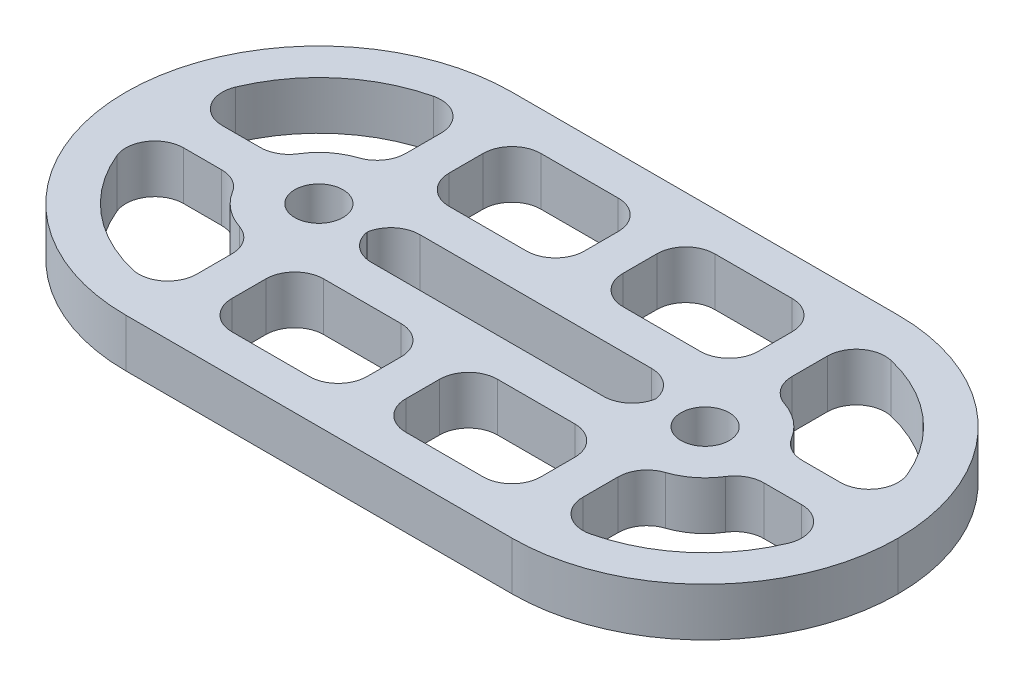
ISO-10303-21;
HEADER;
FILE_DESCRIPTION(('STEP AP214'),'2;1');
FILE_NAME('part.step','',(''),(''),'','','');
FILE_SCHEMA(('AUTOMOTIVE_DESIGN { 1 0 10303 214 1 1 1 1 }'));
ENDSEC;
DATA;
#1=APPLICATION_CONTEXT('core data for automotive mechanical design processes');
#2=APPLICATION_PROTOCOL_DEFINITION('international standard','automotive_design',2000,#1);
#3=PRODUCT_CONTEXT('',#1,'mechanical');
#4=PRODUCT('Part','Part','',(#3));
#5=PRODUCT_RELATED_PRODUCT_CATEGORY('part','',(#4));
#6=PRODUCT_DEFINITION_FORMATION('','',#4);
#7=PRODUCT_DEFINITION_CONTEXT('part definition',#1,'design');
#8=PRODUCT_DEFINITION('design','',#6,#7);
#9=PRODUCT_DEFINITION_SHAPE('','',#8);
#10=(LENGTH_UNIT() NAMED_UNIT(*) SI_UNIT(.MILLI.,.METRE.));
#11=(NAMED_UNIT(*) PLANE_ANGLE_UNIT() SI_UNIT($,.RADIAN.));
#12=(NAMED_UNIT(*) SI_UNIT($,.STERADIAN.) SOLID_ANGLE_UNIT());
#13=UNCERTAINTY_MEASURE_WITH_UNIT(LENGTH_MEASURE(1.E-05),#10,'distance_accuracy_value','');
#14=(GEOMETRIC_REPRESENTATION_CONTEXT(3) GLOBAL_UNCERTAINTY_ASSIGNED_CONTEXT((#13)) GLOBAL_UNIT_ASSIGNED_CONTEXT((#10,
#11,#12)) REPRESENTATION_CONTEXT('',''));
#15=CARTESIAN_POINT('',(0.,0.,0.));
#16=DIRECTION('',(0.,0.,1.));
#17=DIRECTION('',(1.,0.,0.));
#18=AXIS2_PLACEMENT_3D('',#15,#16,#17);
#19=CARTESIAN_POINT('',(0.,3.175,-22.86));
#20=DIRECTION('',(0.,0.,-1.));
#21=DIRECTION('',(-1.,0.,0.));
#22=AXIS2_PLACEMENT_3D('',#19,#20,#21);
#23=PLANE('',#22);
#24=DIRECTION('',(1.,0.,0.));
#25=VECTOR('',#24,1.);
#26=CARTESIAN_POINT('',(0.,0.,-22.86));
#27=LINE('',#26,#25);
#28=CARTESIAN_POINT('',(17.145,0.,-22.86));
#29=VERTEX_POINT('',#28);
#30=CARTESIAN_POINT('',(22.225,0.,-22.86));
#31=VERTEX_POINT('',#30);
#32=EDGE_CURVE('E581',#29,#31,#27,.T.);
#33=ORIENTED_EDGE('',*,*,#32,.T.);
#34=DIRECTION('',(0.,-1.,0.));
#35=VECTOR('',#34,1.);
#36=CARTESIAN_POINT('',(22.225,3.175,-22.86));
#37=LINE('',#36,#35);
#38=CARTESIAN_POINT('',(22.225,3.175,-22.86));
#39=VERTEX_POINT('',#38);
#40=EDGE_CURVE('E624',#31,#39,#37,.F.);
#41=ORIENTED_EDGE('',*,*,#40,.T.);
#42=DIRECTION('',(1.,0.,0.));
#43=VECTOR('',#42,1.);
#44=CARTESIAN_POINT('',(0.,3.175,-22.86));
#45=LINE('',#44,#43);
#46=CARTESIAN_POINT('',(17.145,3.175,-22.86));
#47=VERTEX_POINT('',#46);
#48=EDGE_CURVE('E593',#47,#39,#45,.T.);
#49=ORIENTED_EDGE('',*,*,#48,.F.);
#50=DIRECTION('',(0.,-1.,0.));
#51=VECTOR('',#50,1.);
#52=CARTESIAN_POINT('',(17.145,0.,-22.86));
#53=LINE('',#52,#51);
#54=EDGE_CURVE('E621',#47,#29,#53,.T.);
#55=ORIENTED_EDGE('',*,*,#54,.T.);
#56=EDGE_LOOP('',(#33,#41,#49,#55));
#57=FACE_BOUND('',#56,.T.);
#58=ADVANCED_FACE('F33',(#57),#23,.F.);
#59=CARTESIAN_POINT('',(0.,3.175,-16.8275));
#60=DIRECTION('',(0.,0.,-1.));
#61=DIRECTION('',(-1.,0.,0.));
#62=AXIS2_PLACEMENT_3D('',#59,#60,#61);
#63=PLANE('',#62);
#64=DIRECTION('',(1.,0.,0.));
#65=VECTOR('',#64,1.);
#66=CARTESIAN_POINT('',(0.,3.175,-16.8275));
#67=LINE('',#66,#65);
#68=CARTESIAN_POINT('',(17.145,3.175,-16.8275));
#69=VERTEX_POINT('',#68);
#70=CARTESIAN_POINT('',(22.225,3.175,-16.8275));
#71=VERTEX_POINT('',#70);
#72=EDGE_CURVE('E1032',#69,#71,#67,.T.);
#73=ORIENTED_EDGE('',*,*,#72,.T.);
#74=DIRECTION('',(0.,-1.,0.));
#75=VECTOR('',#74,1.);
#76=CARTESIAN_POINT('',(22.225,0.,-16.8275));
#77=LINE('',#76,#75);
#78=CARTESIAN_POINT('',(22.225,0.,-16.8275));
#79=VERTEX_POINT('',#78);
#80=EDGE_CURVE('E643',#71,#79,#77,.T.);
#81=ORIENTED_EDGE('',*,*,#80,.T.);
#82=DIRECTION('',(1.,0.,0.));
#83=VECTOR('',#82,1.);
#84=CARTESIAN_POINT('',(0.,0.,-16.8275));
#85=LINE('',#84,#83);
#86=CARTESIAN_POINT('',(17.145,0.,-16.8275));
#87=VERTEX_POINT('',#86);
#88=EDGE_CURVE('E1048',#87,#79,#85,.T.);
#89=ORIENTED_EDGE('',*,*,#88,.F.);
#90=DIRECTION('',(0.,-1.,0.));
#91=VECTOR('',#90,1.);
#92=CARTESIAN_POINT('',(17.145,3.175,-16.8275));
#93=LINE('',#92,#91);
#94=EDGE_CURVE('E641',#87,#69,#93,.F.);
#95=ORIENTED_EDGE('',*,*,#94,.T.);
#96=EDGE_LOOP('',(#73,#81,#89,#95));
#97=FACE_BOUND('',#96,.T.);
#98=ADVANCED_FACE('F1144',(#97),#63,.T.);
#99=CARTESIAN_POINT('',(38.1,3.175,-12.7));
#100=DIRECTION('',(0.,-1.,0.));
#101=DIRECTION('',(0.,0.,-1.));
#102=AXIS2_PLACEMENT_3D('',#99,#100,#101);
#103=CYLINDRICAL_SURFACE('',#102,10.16);
#104=CARTESIAN_POINT('',(38.1,0.,-12.7));
#105=DIRECTION('',(0.,-1.,0.));
#106=DIRECTION('',(0.,0.,-1.));
#107=AXIS2_PLACEMENT_3D('',#104,#105,#106);
#108=CIRCLE('',#107,10.16);
#109=CARTESIAN_POINT('',(40.4446153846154,0.,-22.5857664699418));
#110=VERTEX_POINT('',#109);
#111=CARTESIAN_POINT('',(47.4784615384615,0.,-16.6076923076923));
#112=VERTEX_POINT('',#111);
#113=EDGE_CURVE('E579',#110,#112,#108,.T.);
#114=ORIENTED_EDGE('',*,*,#113,.T.);
#115=DIRECTION('',(0.,-1.,0.));
#116=VECTOR('',#115,1.);
#117=CARTESIAN_POINT('',(47.4784615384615,3.175,-16.6076923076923));
#118=LINE('',#117,#116);
#119=CARTESIAN_POINT('',(47.4784615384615,3.175,-16.6076923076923));
#120=VERTEX_POINT('',#119);
#121=EDGE_CURVE('E634',#112,#120,#118,.F.);
#122=ORIENTED_EDGE('',*,*,#121,.T.);
#123=CARTESIAN_POINT('',(38.1,3.175,-12.7));
#124=DIRECTION('',(0.,-1.,0.));
#125=DIRECTION('',(0.,0.,-1.));
#126=AXIS2_PLACEMENT_3D('',#123,#124,#125);
#127=CIRCLE('',#126,10.16);
#128=CARTESIAN_POINT('',(40.4446153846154,3.175,-22.5857664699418));
#129=VERTEX_POINT('',#128);
#130=EDGE_CURVE('E536',#129,#120,#127,.T.);
#131=ORIENTED_EDGE('',*,*,#130,.F.);
#132=DIRECTION('',(0.,-1.,0.));
#133=VECTOR('',#132,1.);
#134=CARTESIAN_POINT('',(40.4446153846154,3.175,-22.5857664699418));
#135=LINE('',#134,#133);
#136=EDGE_CURVE('E631',#129,#110,#135,.T.);
#137=ORIENTED_EDGE('',*,*,#136,.T.);
#138=EDGE_LOOP('',(#114,#122,#131,#137));
#139=FACE_BOUND('',#138,.T.);
#140=ADVANCED_FACE('F1149',(#139),#103,.F.);
#141=CARTESIAN_POINT('',(47.4784615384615,3.175,-8.79230769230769));
#142=VERTEX_POINT('',#141);
#143=CARTESIAN_POINT('',(40.4446153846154,3.175,-2.81423353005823));
#144=VERTEX_POINT('',#143);
#145=EDGE_CURVE('E541',#142,#144,#127,.T.);
#146=ORIENTED_EDGE('',*,*,#145,.F.);
#147=DIRECTION('',(0.,-1.,0.));
#148=VECTOR('',#147,1.);
#149=CARTESIAN_POINT('',(47.4784615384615,3.175,-8.79230769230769));
#150=LINE('',#149,#148);
#151=CARTESIAN_POINT('',(47.4784615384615,0.,-8.79230769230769));
#152=VERTEX_POINT('',#151);
#153=EDGE_CURVE('E693',#142,#152,#150,.T.);
#154=ORIENTED_EDGE('',*,*,#153,.T.);
#155=CARTESIAN_POINT('',(40.4446153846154,0.,-2.81423353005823));
#156=VERTEX_POINT('',#155);
#157=EDGE_CURVE('E576',#152,#156,#108,.T.);
#158=ORIENTED_EDGE('',*,*,#157,.T.);
#159=DIRECTION('',(0.,-1.,0.));
#160=VECTOR('',#159,1.);
#161=CARTESIAN_POINT('',(40.4446153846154,3.175,-2.81423353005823));
#162=LINE('',#161,#160);
#163=EDGE_CURVE('E691',#156,#144,#162,.F.);
#164=ORIENTED_EDGE('',*,*,#163,.T.);
#165=EDGE_LOOP('',(#146,#154,#158,#164));
#166=FACE_BOUND('',#165,.T.);
#167=ADVANCED_FACE('F1157',(#166),#103,.F.);
#168=CARTESIAN_POINT('',(38.1,3.175,-12.7));
#169=DIRECTION('',(0.,-1.,0.));
#170=DIRECTION('',(0.,0.,-1.));
#171=AXIS2_PLACEMENT_3D('',#168,#169,#170);
#172=CYLINDRICAL_SURFACE('',#171,4.1275);
#173=CARTESIAN_POINT('',(38.1,3.175,-12.7));
#174=DIRECTION('',(0.,-1.,0.));
#175=DIRECTION('',(0.,0.,-1.));
#176=AXIS2_PLACEMENT_3D('',#173,#174,#175);
#177=CIRCLE('',#176,4.1275);
#178=CARTESIAN_POINT('',(39.4034210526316,3.175,-16.616292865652));
#179=VERTEX_POINT('',#178);
#180=CARTESIAN_POINT('',(41.6095685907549,3.175,-14.8723684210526));
#181=VERTEX_POINT('',#180);
#182=EDGE_CURVE('E1031',#179,#181,#177,.T.);
#183=ORIENTED_EDGE('',*,*,#182,.T.);
#184=DIRECTION('',(0.,-1.,0.));
#185=VECTOR('',#184,1.);
#186=CARTESIAN_POINT('',(41.6095685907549,3.175,-14.8723684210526));
#187=LINE('',#186,#185);
#188=CARTESIAN_POINT('',(41.6095685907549,0.,-14.8723684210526));
#189=VERTEX_POINT('',#188);
#190=EDGE_CURVE('E648',#181,#189,#187,.T.);
#191=ORIENTED_EDGE('',*,*,#190,.T.);
#192=CARTESIAN_POINT('',(38.1,0.,-12.7));
#193=DIRECTION('',(0.,-1.,0.));
#194=DIRECTION('',(0.,0.,-1.));
#195=AXIS2_PLACEMENT_3D('',#192,#193,#194);
#196=CIRCLE('',#195,4.1275);
#197=CARTESIAN_POINT('',(39.4034210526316,0.,-16.616292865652));
#198=VERTEX_POINT('',#197);
#199=EDGE_CURVE('E1047',#198,#189,#196,.T.);
#200=ORIENTED_EDGE('',*,*,#199,.F.);
#201=DIRECTION('',(0.,-1.,0.));
#202=VECTOR('',#201,1.);
#203=CARTESIAN_POINT('',(39.4034210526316,3.175,-16.616292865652));
#204=LINE('',#203,#202);
#205=EDGE_CURVE('E646',#198,#179,#204,.F.);
#206=ORIENTED_EDGE('',*,*,#205,.T.);
#207=EDGE_LOOP('',(#183,#191,#200,#206));
#208=FACE_BOUND('',#207,.T.);
#209=ADVANCED_FACE('F1162',(#208),#172,.T.);
#210=CARTESIAN_POINT('',(41.6095685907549,0.,-10.5276315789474));
#211=VERTEX_POINT('',#210);
#212=CARTESIAN_POINT('',(39.4034210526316,0.,-8.78370713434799));
#213=VERTEX_POINT('',#212);
#214=EDGE_CURVE('E1044',#211,#213,#196,.T.);
#215=ORIENTED_EDGE('',*,*,#214,.F.);
#216=DIRECTION('',(0.,-1.,0.));
#217=VECTOR('',#216,1.);
#218=CARTESIAN_POINT('',(41.6095685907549,3.175,-10.5276315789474));
#219=LINE('',#218,#217);
#220=CARTESIAN_POINT('',(41.6095685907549,3.175,-10.5276315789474));
#221=VERTEX_POINT('',#220);
#222=EDGE_CURVE('E698',#211,#221,#219,.F.);
#223=ORIENTED_EDGE('',*,*,#222,.T.);
#224=CARTESIAN_POINT('',(39.4034210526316,3.175,-8.78370713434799));
#225=VERTEX_POINT('',#224);
#226=EDGE_CURVE('E1028',#221,#225,#177,.T.);
#227=ORIENTED_EDGE('',*,*,#226,.T.);
#228=DIRECTION('',(0.,-1.,0.));
#229=VECTOR('',#228,1.);
#230=CARTESIAN_POINT('',(39.4034210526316,3.175,-8.78370713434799));
#231=LINE('',#230,#229);
#232=EDGE_CURVE('E695',#225,#213,#231,.T.);
#233=ORIENTED_EDGE('',*,*,#232,.T.);
#234=EDGE_LOOP('',(#215,#223,#227,#233));
#235=FACE_BOUND('',#234,.T.);
#236=ADVANCED_FACE('F1945',(#235),#172,.T.);
#237=CARTESIAN_POINT('',(0.,3.175,-2.54));
#238=DIRECTION('',(0.,0.,-1.));
#239=DIRECTION('',(-1.,0.,0.));
#240=AXIS2_PLACEMENT_3D('',#237,#238,#239);
#241=PLANE('',#240);
#242=DIRECTION('',(1.,0.,0.));
#243=VECTOR('',#242,1.);
#244=CARTESIAN_POINT('',(0.,3.175,-2.54));
#245=LINE('',#244,#243);
#246=CARTESIAN_POINT('',(28.575,3.175,-2.54));
#247=VERTEX_POINT('',#246);
#248=CARTESIAN_POINT('',(33.655,3.175,-2.54));
#249=VERTEX_POINT('',#248);
#250=EDGE_CURVE('E572',#247,#249,#245,.T.);
#251=ORIENTED_EDGE('',*,*,#250,.T.);
#252=DIRECTION('',(0.,-1.,0.));
#253=VECTOR('',#252,1.);
#254=CARTESIAN_POINT('',(33.655,3.175,-2.54));
#255=LINE('',#254,#253);
#256=CARTESIAN_POINT('',(33.655,0.,-2.54));
#257=VERTEX_POINT('',#256);
#258=EDGE_CURVE('E708',#249,#257,#255,.T.);
#259=ORIENTED_EDGE('',*,*,#258,.T.);
#260=DIRECTION('',(1.,0.,0.));
#261=VECTOR('',#260,1.);
#262=CARTESIAN_POINT('',(0.,0.,-2.54));
#263=LINE('',#262,#261);
#264=CARTESIAN_POINT('',(28.575,0.,-2.54));
#265=VERTEX_POINT('',#264);
#266=EDGE_CURVE('E529',#265,#257,#263,.T.);
#267=ORIENTED_EDGE('',*,*,#266,.F.);
#268=DIRECTION('',(0.,-1.,0.));
#269=VECTOR('',#268,1.);
#270=CARTESIAN_POINT('',(28.575,3.175,-2.54));
#271=LINE('',#270,#269);
#272=EDGE_CURVE('E706',#265,#247,#271,.F.);
#273=ORIENTED_EDGE('',*,*,#272,.T.);
#274=EDGE_LOOP('',(#251,#259,#267,#273));
#275=FACE_BOUND('',#274,.T.);
#276=ADVANCED_FACE('F1134',(#275),#241,.T.);
#277=CARTESIAN_POINT('',(0.,3.175,-8.5725));
#278=DIRECTION('',(0.,0.,-1.));
#279=DIRECTION('',(-1.,0.,0.));
#280=AXIS2_PLACEMENT_3D('',#277,#278,#279);
#281=PLANE('',#280);
#282=DIRECTION('',(1.,0.,0.));
#283=VECTOR('',#282,1.);
#284=CARTESIAN_POINT('',(0.,0.,-8.5725));
#285=LINE('',#284,#283);
#286=CARTESIAN_POINT('',(28.575,0.,-8.5725));
#287=VERTEX_POINT('',#286);
#288=CARTESIAN_POINT('',(33.655,0.,-8.5725));
#289=VERTEX_POINT('',#288);
#290=EDGE_CURVE('E1040',#287,#289,#285,.T.);
#291=ORIENTED_EDGE('',*,*,#290,.T.);
#292=DIRECTION('',(0.,-1.,0.));
#293=VECTOR('',#292,1.);
#294=CARTESIAN_POINT('',(33.655,3.175,-8.5725));
#295=LINE('',#294,#293);
#296=CARTESIAN_POINT('',(33.655,3.175,-8.5725));
#297=VERTEX_POINT('',#296);
#298=EDGE_CURVE('E719',#289,#297,#295,.F.);
#299=ORIENTED_EDGE('',*,*,#298,.T.);
#300=DIRECTION('',(1.,0.,0.));
#301=VECTOR('',#300,1.);
#302=CARTESIAN_POINT('',(0.,3.175,-8.5725));
#303=LINE('',#302,#301);
#304=CARTESIAN_POINT('',(28.575,3.175,-8.5725));
#305=VERTEX_POINT('',#304);
#306=EDGE_CURVE('E1023',#305,#297,#303,.T.);
#307=ORIENTED_EDGE('',*,*,#306,.F.);
#308=DIRECTION('',(0.,-1.,0.));
#309=VECTOR('',#308,1.);
#310=CARTESIAN_POINT('',(28.575,3.175,-8.5725));
#311=LINE('',#310,#309);
#312=EDGE_CURVE('E716',#305,#287,#311,.T.);
#313=ORIENTED_EDGE('',*,*,#312,.T.);
#314=EDGE_LOOP('',(#291,#299,#307,#313));
#315=FACE_BOUND('',#314,.T.);
#316=ADVANCED_FACE('F1141',(#315),#281,.F.);
#317=CARTESIAN_POINT('',(12.7,3.175,-12.7));
#318=DIRECTION('',(0.,-1.,0.));
#319=DIRECTION('',(0.,0.,-1.));
#320=AXIS2_PLACEMENT_3D('',#317,#318,#319);
#321=CYLINDRICAL_SURFACE('',#320,10.16);
#322=CARTESIAN_POINT('',(12.7,0.,-12.7));
#323=DIRECTION('',(0.,-1.,0.));
#324=DIRECTION('',(0.,0.,-1.));
#325=AXIS2_PLACEMENT_3D('',#322,#323,#324);
#326=CIRCLE('',#325,10.16);
#327=CARTESIAN_POINT('',(10.3553846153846,0.,-2.81423353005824));
#328=VERTEX_POINT('',#327);
#329=CARTESIAN_POINT('',(3.32153846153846,0.,-8.79230769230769));
#330=VERTEX_POINT('',#329);
#331=EDGE_CURVE('E569',#328,#330,#326,.T.);
#332=ORIENTED_EDGE('',*,*,#331,.T.);
#333=DIRECTION('',(0.,-1.,0.));
#334=VECTOR('',#333,1.);
#335=CARTESIAN_POINT('',(3.32153846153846,3.175,-8.79230769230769));
#336=LINE('',#335,#334);
#337=CARTESIAN_POINT('',(3.32153846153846,3.175,-8.79230769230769));
#338=VERTEX_POINT('',#337);
#339=EDGE_CURVE('E729',#330,#338,#336,.F.);
#340=ORIENTED_EDGE('',*,*,#339,.T.);
#341=CARTESIAN_POINT('',(12.7,3.175,-12.7));
#342=DIRECTION('',(0.,-1.,0.));
#343=DIRECTION('',(0.,0.,-1.));
#344=AXIS2_PLACEMENT_3D('',#341,#342,#343);
#345=CIRCLE('',#344,10.16);
#346=CARTESIAN_POINT('',(10.3553846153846,3.175,-2.81423353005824));
#347=VERTEX_POINT('',#346);
#348=EDGE_CURVE('E585',#347,#338,#345,.T.);
#349=ORIENTED_EDGE('',*,*,#348,.F.);
#350=DIRECTION('',(0.,-1.,0.));
#351=VECTOR('',#350,1.);
#352=CARTESIAN_POINT('',(10.3553846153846,3.175,-2.81423353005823));
#353=LINE('',#352,#351);
#354=EDGE_CURVE('E726',#347,#328,#353,.T.);
#355=ORIENTED_EDGE('',*,*,#354,.T.);
#356=EDGE_LOOP('',(#332,#340,#349,#355));
#357=FACE_BOUND('',#356,.T.);
#358=ADVANCED_FACE('F1126',(#357),#321,.F.);
#359=CARTESIAN_POINT('',(12.7,3.175,-12.7));
#360=DIRECTION('',(0.,-1.,0.));
#361=DIRECTION('',(0.,0.,-1.));
#362=AXIS2_PLACEMENT_3D('',#359,#360,#361);
#363=CYLINDRICAL_SURFACE('',#362,4.1275);
#364=CARTESIAN_POINT('',(12.7,3.175,-12.7));
#365=DIRECTION('',(0.,-1.,0.));
#366=DIRECTION('',(0.,0.,-1.));
#367=AXIS2_PLACEMENT_3D('',#364,#365,#366);
#368=CIRCLE('',#367,4.1275);
#369=CARTESIAN_POINT('',(11.3965789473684,3.175,-8.78370713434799));
#370=VERTEX_POINT('',#369);
#371=CARTESIAN_POINT('',(9.19043140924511,3.175,-10.5276315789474));
#372=VERTEX_POINT('',#371);
#373=EDGE_CURVE('E1020',#370,#372,#368,.T.);
#374=ORIENTED_EDGE('',*,*,#373,.T.);
#375=DIRECTION('',(0.,-1.,0.));
#376=VECTOR('',#375,1.);
#377=CARTESIAN_POINT('',(9.1904314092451,3.175,-10.5276315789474));
#378=LINE('',#377,#376);
#379=CARTESIAN_POINT('',(9.19043140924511,0.,-10.5276315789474));
#380=VERTEX_POINT('',#379);
#381=EDGE_CURVE('E739',#372,#380,#378,.T.);
#382=ORIENTED_EDGE('',*,*,#381,.T.);
#383=CARTESIAN_POINT('',(12.7,0.,-12.7));
#384=DIRECTION('',(0.,-1.,0.));
#385=DIRECTION('',(0.,0.,-1.));
#386=AXIS2_PLACEMENT_3D('',#383,#384,#385);
#387=CIRCLE('',#386,4.1275);
#388=CARTESIAN_POINT('',(11.3965789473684,0.,-8.78370713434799));
#389=VERTEX_POINT('',#388);
#390=EDGE_CURVE('E1037',#389,#380,#387,.T.);
#391=ORIENTED_EDGE('',*,*,#390,.F.);
#392=DIRECTION('',(0.,-1.,0.));
#393=VECTOR('',#392,1.);
#394=CARTESIAN_POINT('',(11.3965789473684,3.175,-8.78370713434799));
#395=LINE('',#394,#393);
#396=EDGE_CURVE('E737',#389,#370,#395,.F.);
#397=ORIENTED_EDGE('',*,*,#396,.T.);
#398=EDGE_LOOP('',(#374,#382,#391,#397));
#399=FACE_BOUND('',#398,.T.);
#400=ADVANCED_FACE('F1140',(#399),#363,.T.);
#401=CARTESIAN_POINT('',(0.,3.175,0.));
#402=DIRECTION('',(0.,0.,-1.));
#403=DIRECTION('',(-1.,0.,0.));
#404=AXIS2_PLACEMENT_3D('',#401,#402,#403);
#405=PLANE('',#404);
#406=DIRECTION('',(1.,0.,0.));
#407=VECTOR('',#406,1.);
#408=CARTESIAN_POINT('',(0.,3.175,0.));
#409=LINE('',#408,#407);
#410=CARTESIAN_POINT('',(12.7,3.175,0.));
#411=VERTEX_POINT('',#410);
#412=CARTESIAN_POINT('',(38.1,3.175,0.));
#413=VERTEX_POINT('',#412);
#414=EDGE_CURVE('E538',#411,#413,#409,.T.);
#415=ORIENTED_EDGE('',*,*,#414,.F.);
#416=DIRECTION('',(0.,-1.,0.));
#417=VECTOR('',#416,1.);
#418=CARTESIAN_POINT('',(12.7,3.175,0.));
#419=LINE('',#418,#417);
#420=CARTESIAN_POINT('',(12.7,0.,0.));
#421=VERTEX_POINT('',#420);
#422=EDGE_CURVE('E557',#411,#421,#419,.T.);
#423=ORIENTED_EDGE('',*,*,#422,.T.);
#424=DIRECTION('',(1.,0.,0.));
#425=VECTOR('',#424,1.);
#426=CARTESIAN_POINT('',(0.,0.,0.));
#427=LINE('',#426,#425);
#428=CARTESIAN_POINT('',(38.1,0.,0.));
#429=VERTEX_POINT('',#428);
#430=EDGE_CURVE('E560',#421,#429,#427,.T.);
#431=ORIENTED_EDGE('',*,*,#430,.T.);
#432=DIRECTION('',(0.,-1.,0.));
#433=VECTOR('',#432,1.);
#434=CARTESIAN_POINT('',(38.1,3.175,0.));
#435=LINE('',#434,#433);
#436=EDGE_CURVE('E562',#429,#413,#435,.F.);
#437=ORIENTED_EDGE('',*,*,#436,.T.);
#438=EDGE_LOOP('',(#415,#423,#431,#437));
#439=FACE_BOUND('',#438,.T.);
#440=ADVANCED_FACE('F1379',(#439),#405,.F.);
#441=CARTESIAN_POINT('',(0.,3.175,-25.4));
#442=DIRECTION('',(0.,0.,1.));
#443=DIRECTION('',(1.,0.,0.));
#444=AXIS2_PLACEMENT_3D('',#441,#442,#443);
#445=PLANE('',#444);
#446=DIRECTION('',(-1.,0.,0.));
#447=VECTOR('',#446,1.);
#448=CARTESIAN_POINT('',(0.,0.,-25.4));
#449=LINE('',#448,#447);
#450=CARTESIAN_POINT('',(38.1,0.,-25.4));
#451=VERTEX_POINT('',#450);
#452=CARTESIAN_POINT('',(12.7,0.,-25.4));
#453=VERTEX_POINT('',#452);
#454=EDGE_CURVE('E516',#451,#453,#449,.T.);
#455=ORIENTED_EDGE('',*,*,#454,.T.);
#456=DIRECTION('',(0.,-1.,0.));
#457=VECTOR('',#456,1.);
#458=CARTESIAN_POINT('',(12.7,3.175,-25.4));
#459=LINE('',#458,#457);
#460=CARTESIAN_POINT('',(12.7,3.175,-25.4));
#461=VERTEX_POINT('',#460);
#462=EDGE_CURVE('E509',#453,#461,#459,.F.);
#463=ORIENTED_EDGE('',*,*,#462,.T.);
#464=DIRECTION('',(-1.,0.,0.));
#465=VECTOR('',#464,1.);
#466=CARTESIAN_POINT('',(0.,3.175,-25.4));
#467=LINE('',#466,#465);
#468=CARTESIAN_POINT('',(38.1,3.175,-25.4));
#469=VERTEX_POINT('',#468);
#470=EDGE_CURVE('E513',#469,#461,#467,.T.);
#471=ORIENTED_EDGE('',*,*,#470,.F.);
#472=DIRECTION('',(0.,-1.,0.));
#473=VECTOR('',#472,1.);
#474=CARTESIAN_POINT('',(38.1,3.175,-25.4));
#475=LINE('',#474,#473);
#476=EDGE_CURVE('E520',#469,#451,#475,.T.);
#477=ORIENTED_EDGE('',*,*,#476,.T.);
#478=EDGE_LOOP('',(#455,#463,#471,#477));
#479=FACE_BOUND('',#478,.T.);
#480=ADVANCED_FACE('F511',(#479),#445,.F.);
#481=CARTESIAN_POINT('',(0.,3.175,0.));
#482=DIRECTION('',(0.,-1.,0.));
#483=DIRECTION('',(0.,0.,-1.));
#484=AXIS2_PLACEMENT_3D('',#481,#482,#483);
#485=PLANE('',#484);
#486=CARTESIAN_POINT('',(33.02,3.175,-12.35075));
#487=DIRECTION('',(0.,-1.,0.));
#488=DIRECTION('',(0.,0.,-1.));
#489=AXIS2_PLACEMENT_3D('',#486,#487,#488);
#490=CIRCLE('',#489,1.905);
#491=CARTESIAN_POINT('',(33.02,3.175,-14.25575));
#492=VERTEX_POINT('',#491);
#493=CARTESIAN_POINT('',(34.8983553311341,3.175,-12.66825));
#494=VERTEX_POINT('',#493);
#495=EDGE_CURVE('E50',#492,#494,#490,.T.);
#496=ORIENTED_EDGE('',*,*,#495,.T.);
#497=CARTESIAN_POINT('',(33.02,3.175,-12.98575));
#498=DIRECTION('',(0.,-1.,0.));
#499=DIRECTION('',(0.,0.,-1.));
#500=AXIS2_PLACEMENT_3D('',#497,#498,#499);
#501=CIRCLE('',#500,1.905);
#502=CARTESIAN_POINT('',(33.02,3.175,-11.08075));
#503=VERTEX_POINT('',#502);
#504=EDGE_CURVE('E774',#494,#503,#501,.T.);
#505=ORIENTED_EDGE('',*,*,#504,.T.);
#506=DIRECTION('',(-1.,0.,0.));
#507=VECTOR('',#506,1.);
#508=CARTESIAN_POINT('',(15.875,3.175,-11.08075));
#509=LINE('',#508,#507);
#510=CARTESIAN_POINT('',(17.78,3.175,-11.08075));
#511=VERTEX_POINT('',#510);
#512=EDGE_CURVE('E924',#503,#511,#509,.T.);
#513=ORIENTED_EDGE('',*,*,#512,.T.);
#514=CARTESIAN_POINT('',(17.78,3.175,-12.98575));
#515=DIRECTION('',(0.,-1.,0.));
#516=DIRECTION('',(0.,0.,-1.));
#517=AXIS2_PLACEMENT_3D('',#514,#515,#516);
#518=CIRCLE('',#517,1.905);
#519=CARTESIAN_POINT('',(15.9016446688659,3.175,-12.66825));
#520=VERTEX_POINT('',#519);
#521=EDGE_CURVE('E778',#511,#520,#518,.T.);
#522=ORIENTED_EDGE('',*,*,#521,.T.);
#523=CARTESIAN_POINT('',(17.78,3.175,-12.35075));
#524=DIRECTION('',(0.,-1.,0.));
#525=DIRECTION('',(0.,0.,-1.));
#526=AXIS2_PLACEMENT_3D('',#523,#524,#525);
#527=CIRCLE('',#526,1.905);
#528=CARTESIAN_POINT('',(17.78,3.175,-14.25575));
#529=VERTEX_POINT('',#528);
#530=EDGE_CURVE('E768',#520,#529,#527,.T.);
#531=ORIENTED_EDGE('',*,*,#530,.T.);
#532=DIRECTION('',(1.,0.,0.));
#533=VECTOR('',#532,1.);
#534=CARTESIAN_POINT('',(15.875,3.175,-14.25575));
#535=LINE('',#534,#533);
#536=EDGE_CURVE('E931',#529,#492,#535,.T.);
#537=ORIENTED_EDGE('',*,*,#536,.T.);
#538=EDGE_LOOP('',(#496,#505,#513,#522,#531,#537));
#539=FACE_BOUND('',#538,.T.);
#540=DIRECTION('',(0.,0.,-1.));
#541=VECTOR('',#540,1.);
#542=CARTESIAN_POINT('',(12.7,3.175,-8.5725));
#543=LINE('',#542,#541);
#544=CARTESIAN_POINT('',(12.7,3.175,-4.66781474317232));
#545=VERTEX_POINT('',#544);
#546=CARTESIAN_POINT('',(12.7,3.175,-6.97618735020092));
#547=VERTEX_POINT('',#546);
#548=EDGE_CURVE('E1008',#545,#547,#543,.T.);
#549=ORIENTED_EDGE('',*,*,#548,.F.);
#550=CARTESIAN_POINT('',(10.795,3.175,-4.66781474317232));
#551=DIRECTION('',(0.,-1.,0.));
#552=DIRECTION('',(0.,0.,-1.));
#553=AXIS2_PLACEMENT_3D('',#550,#551,#552);
#554=CIRCLE('',#553,1.905);
#555=EDGE_CURVE('E890',#545,#347,#554,.T.);
#556=ORIENTED_EDGE('',*,*,#555,.T.);
#557=ORIENTED_EDGE('',*,*,#348,.T.);
#558=CARTESIAN_POINT('',(5.08,3.175,-9.525));
#559=DIRECTION('',(0.,-1.,0.));
#560=DIRECTION('',(0.,0.,-1.));
#561=AXIS2_PLACEMENT_3D('',#558,#559,#560);
#562=CIRCLE('',#561,1.905);
#563=CARTESIAN_POINT('',(5.08,3.175,-11.43));
#564=VERTEX_POINT('',#563);
#565=EDGE_CURVE('E876',#338,#564,#562,.T.);
#566=ORIENTED_EDGE('',*,*,#565,.T.);
#567=DIRECTION('',(-1.,0.,0.));
#568=VECTOR('',#567,1.);
#569=CARTESIAN_POINT('',(2.54,3.175,-11.43));
#570=LINE('',#569,#568);
#571=CARTESIAN_POINT('',(7.57063052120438,3.175,-11.43));
#572=VERTEX_POINT('',#571);
#573=EDGE_CURVE('E999',#572,#564,#570,.T.);
#574=ORIENTED_EDGE('',*,*,#573,.F.);
#575=CARTESIAN_POINT('',(7.57063052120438,3.175,-9.525));
#576=DIRECTION('',(0.,-1.,0.));
#577=DIRECTION('',(0.,0.,-1.));
#578=AXIS2_PLACEMENT_3D('',#575,#576,#577);
#579=CIRCLE('',#578,1.905);
#580=EDGE_CURVE('E880',#572,#372,#579,.T.);
#581=ORIENTED_EDGE('',*,*,#580,.T.);
#582=ORIENTED_EDGE('',*,*,#373,.F.);
#583=CARTESIAN_POINT('',(10.795,3.175,-6.97618735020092));
#584=DIRECTION('',(0.,-1.,0.));
#585=DIRECTION('',(0.,0.,-1.));
#586=AXIS2_PLACEMENT_3D('',#583,#584,#585);
#587=CIRCLE('',#586,1.905);
#588=EDGE_CURVE('E886',#370,#547,#587,.T.);
#589=ORIENTED_EDGE('',*,*,#588,.T.);
#590=EDGE_LOOP('',(#549,#556,#557,#566,#574,#581,#582,#589));
#591=FACE_BOUND('',#590,.T.);
#592=CARTESIAN_POINT('',(9.19043140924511,3.175,-14.8723684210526));
#593=VERTEX_POINT('',#592);
#594=CARTESIAN_POINT('',(11.3965789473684,3.175,-16.616292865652));
#595=VERTEX_POINT('',#594);
#596=EDGE_CURVE('E1024',#593,#595,#368,.T.);
#597=ORIENTED_EDGE('',*,*,#596,.F.);
#598=CARTESIAN_POINT('',(7.57063052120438,3.175,-15.875));
#599=DIRECTION('',(0.,-1.,0.));
#600=DIRECTION('',(0.,0.,-1.));
#601=AXIS2_PLACEMENT_3D('',#598,#599,#600);
#602=CIRCLE('',#601,1.905);
#603=CARTESIAN_POINT('',(7.57063052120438,3.175,-13.97));
#604=VERTEX_POINT('',#603);
#605=EDGE_CURVE('E838',#593,#604,#602,.T.);
#606=ORIENTED_EDGE('',*,*,#605,.T.);
#607=DIRECTION('',(1.,0.,0.));
#608=VECTOR('',#607,1.);
#609=CARTESIAN_POINT('',(2.54,3.175,-13.97));
#610=LINE('',#609,#608);
#611=CARTESIAN_POINT('',(5.08,3.175,-13.97));
#612=VERTEX_POINT('',#611);
#613=EDGE_CURVE('E996',#612,#604,#610,.T.);
#614=ORIENTED_EDGE('',*,*,#613,.F.);
#615=CARTESIAN_POINT('',(5.08,3.175,-15.875));
#616=DIRECTION('',(0.,-1.,0.));
#617=DIRECTION('',(0.,0.,-1.));
#618=AXIS2_PLACEMENT_3D('',#615,#616,#617);
#619=CIRCLE('',#618,1.905);
#620=CARTESIAN_POINT('',(3.32153846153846,3.175,-16.6076923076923));
#621=VERTEX_POINT('',#620);
#622=EDGE_CURVE('E842',#612,#621,#619,.T.);
#623=ORIENTED_EDGE('',*,*,#622,.T.);
#624=CARTESIAN_POINT('',(10.3553846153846,3.175,-22.5857664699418));
#625=VERTEX_POINT('',#624);
#626=EDGE_CURVE('E589',#621,#625,#345,.T.);
#627=ORIENTED_EDGE('',*,*,#626,.T.);
#628=CARTESIAN_POINT('',(10.795,3.175,-20.7321852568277));
#629=DIRECTION('',(0.,-1.,0.));
#630=DIRECTION('',(0.,0.,-1.));
#631=AXIS2_PLACEMENT_3D('',#628,#629,#630);
#632=CIRCLE('',#631,1.905);
#633=CARTESIAN_POINT('',(12.7,3.175,-20.7321852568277));
#634=VERTEX_POINT('',#633);
#635=EDGE_CURVE('E834',#625,#634,#632,.T.);
#636=ORIENTED_EDGE('',*,*,#635,.T.);
#637=DIRECTION('',(0.,0.,1.));
#638=VECTOR('',#637,1.);
#639=CARTESIAN_POINT('',(12.7,3.175,-16.8275));
#640=LINE('',#639,#638);
#641=CARTESIAN_POINT('',(12.7,3.175,-18.4238126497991));
#642=VERTEX_POINT('',#641);
#643=EDGE_CURVE('E939',#634,#642,#640,.T.);
#644=ORIENTED_EDGE('',*,*,#643,.T.);
#645=CARTESIAN_POINT('',(10.795,3.175,-18.4238126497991));
#646=DIRECTION('',(0.,-1.,0.));
#647=DIRECTION('',(0.,0.,-1.));
#648=AXIS2_PLACEMENT_3D('',#645,#646,#647);
#649=CIRCLE('',#648,1.905);
#650=EDGE_CURVE('E830',#642,#595,#649,.T.);
#651=ORIENTED_EDGE('',*,*,#650,.T.);
#652=EDGE_LOOP('',(#597,#606,#614,#623,#627,#636,#644,#651));
#653=FACE_BOUND('',#652,.T.);
#654=ORIENTED_EDGE('',*,*,#130,.T.);
#655=CARTESIAN_POINT('',(45.72,3.175,-15.875));
#656=DIRECTION('',(0.,-1.,0.));
#657=DIRECTION('',(0.,0.,-1.));
#658=AXIS2_PLACEMENT_3D('',#655,#656,#657);
#659=CIRCLE('',#658,1.905);
#660=CARTESIAN_POINT('',(45.72,3.175,-13.97));
#661=VERTEX_POINT('',#660);
#662=EDGE_CURVE('E790',#120,#661,#659,.T.);
#663=ORIENTED_EDGE('',*,*,#662,.T.);
#664=DIRECTION('',(-1.,0.,0.));
#665=VECTOR('',#664,1.);
#666=CARTESIAN_POINT('',(48.26,3.175,-13.97));
#667=LINE('',#666,#665);
#668=CARTESIAN_POINT('',(43.2293694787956,3.175,-13.97));
#669=VERTEX_POINT('',#668);
#670=EDGE_CURVE('E975',#661,#669,#667,.T.);
#671=ORIENTED_EDGE('',*,*,#670,.T.);
#672=CARTESIAN_POINT('',(43.2293694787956,3.175,-15.875));
#673=DIRECTION('',(0.,-1.,0.));
#674=DIRECTION('',(0.,0.,-1.));
#675=AXIS2_PLACEMENT_3D('',#672,#673,#674);
#676=CIRCLE('',#675,1.905);
#677=EDGE_CURVE('E802',#669,#181,#676,.T.);
#678=ORIENTED_EDGE('',*,*,#677,.T.);
#679=ORIENTED_EDGE('',*,*,#182,.F.);
#680=CARTESIAN_POINT('',(40.005,3.175,-18.4238126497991));
#681=DIRECTION('',(0.,-1.,0.));
#682=DIRECTION('',(0.,0.,-1.));
#683=AXIS2_PLACEMENT_3D('',#680,#681,#682);
#684=CIRCLE('',#683,1.905);
#685=CARTESIAN_POINT('',(38.1,3.175,-18.4238126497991));
#686=VERTEX_POINT('',#685);
#687=EDGE_CURVE('E806',#179,#686,#684,.T.);
#688=ORIENTED_EDGE('',*,*,#687,.T.);
#689=DIRECTION('',(0.,0.,1.));
#690=VECTOR('',#689,1.);
#691=CARTESIAN_POINT('',(38.1,3.175,-16.8275));
#692=LINE('',#691,#690);
#693=CARTESIAN_POINT('',(38.1,3.175,-20.7321852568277));
#694=VERTEX_POINT('',#693);
#695=EDGE_CURVE('E948',#694,#686,#692,.T.);
#696=ORIENTED_EDGE('',*,*,#695,.F.);
#697=CARTESIAN_POINT('',(40.005,3.175,-20.7321852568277));
#698=DIRECTION('',(0.,-1.,0.));
#699=DIRECTION('',(0.,0.,-1.));
#700=AXIS2_PLACEMENT_3D('',#697,#698,#699);
#701=CIRCLE('',#700,1.905);
#702=EDGE_CURVE('E814',#694,#129,#701,.T.);
#703=ORIENTED_EDGE('',*,*,#702,.T.);
#704=EDGE_LOOP('',(#654,#663,#671,#678,#679,#688,#696,#703));
#705=FACE_BOUND('',#704,.T.);
#706=ORIENTED_EDGE('',*,*,#226,.F.);
#707=CARTESIAN_POINT('',(43.2293694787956,3.175,-9.525));
#708=DIRECTION('',(0.,-1.,0.));
#709=DIRECTION('',(0.,0.,-1.));
#710=AXIS2_PLACEMENT_3D('',#707,#708,#709);
#711=CIRCLE('',#710,1.905);
#712=CARTESIAN_POINT('',(43.2293694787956,3.175,-11.43));
#713=VERTEX_POINT('',#712);
#714=EDGE_CURVE('E848',#221,#713,#711,.T.);
#715=ORIENTED_EDGE('',*,*,#714,.T.);
#716=DIRECTION('',(1.,0.,0.));
#717=VECTOR('',#716,1.);
#718=CARTESIAN_POINT('',(48.26,3.175,-11.43));
#719=LINE('',#718,#717);
#720=CARTESIAN_POINT('',(45.72,3.175,-11.43));
#721=VERTEX_POINT('',#720);
#722=EDGE_CURVE('E972',#713,#721,#719,.T.);
#723=ORIENTED_EDGE('',*,*,#722,.T.);
#724=CARTESIAN_POINT('',(45.72,3.175,-9.525));
#725=DIRECTION('',(0.,-1.,0.));
#726=DIRECTION('',(0.,0.,-1.));
#727=AXIS2_PLACEMENT_3D('',#724,#725,#726);
#728=CIRCLE('',#727,1.905);
#729=EDGE_CURVE('E844',#721,#142,#728,.T.);
#730=ORIENTED_EDGE('',*,*,#729,.T.);
#731=ORIENTED_EDGE('',*,*,#145,.T.);
#732=CARTESIAN_POINT('',(40.005,3.175,-4.66781474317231));
#733=DIRECTION('',(0.,-1.,0.));
#734=DIRECTION('',(0.,0.,-1.));
#735=AXIS2_PLACEMENT_3D('',#732,#733,#734);
#736=CIRCLE('',#735,1.905);
#737=CARTESIAN_POINT('',(38.1,3.175,-4.66781474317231));
#738=VERTEX_POINT('',#737);
#739=EDGE_CURVE('E858',#144,#738,#736,.T.);
#740=ORIENTED_EDGE('',*,*,#739,.T.);
#741=DIRECTION('',(0.,0.,-1.));
#742=VECTOR('',#741,1.);
#743=CARTESIAN_POINT('',(38.1,3.175,-8.5725));
#744=LINE('',#743,#742);
#745=CARTESIAN_POINT('',(38.1,3.175,-6.97618735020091));
#746=VERTEX_POINT('',#745);
#747=EDGE_CURVE('E984',#738,#746,#744,.T.);
#748=ORIENTED_EDGE('',*,*,#747,.T.);
#749=CARTESIAN_POINT('',(40.005,3.175,-6.97618735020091));
#750=DIRECTION('',(0.,-1.,0.));
#751=DIRECTION('',(0.,0.,-1.));
#752=AXIS2_PLACEMENT_3D('',#749,#750,#751);
#753=CIRCLE('',#752,1.905);
#754=EDGE_CURVE('E854',#746,#225,#753,.T.);
#755=ORIENTED_EDGE('',*,*,#754,.T.);
#756=EDGE_LOOP('',(#706,#715,#723,#730,#731,#740,#748,#755));
#757=FACE_BOUND('',#756,.T.);
#758=CARTESIAN_POINT('',(12.7,3.175,-12.7));
#759=DIRECTION('',(0.,-1.,0.));
#760=DIRECTION('',(0.,0.,-1.));
#761=AXIS2_PLACEMENT_3D('',#758,#759,#760);
#762=CIRCLE('',#761,12.7);
#763=CARTESIAN_POINT('',(0.,3.175,-12.7));
#764=VERTEX_POINT('',#763);
#765=EDGE_CURVE('E525',#461,#764,#762,.F.);
#766=ORIENTED_EDGE('',*,*,#765,.T.);
#767=CARTESIAN_POINT('',(12.7,3.175,-12.7));
#768=DIRECTION('',(0.,-1.,0.));
#769=DIRECTION('',(0.,0.,-1.));
#770=AXIS2_PLACEMENT_3D('',#767,#768,#769);
#771=CIRCLE('',#770,12.7);
#772=EDGE_CURVE('E535',#764,#411,#771,.F.);
#773=ORIENTED_EDGE('',*,*,#772,.T.);
#774=ORIENTED_EDGE('',*,*,#414,.T.);
#775=CARTESIAN_POINT('',(38.1,3.175,-12.7));
#776=DIRECTION('',(0.,-1.,0.));
#777=DIRECTION('',(0.,0.,-1.));
#778=AXIS2_PLACEMENT_3D('',#775,#776,#777);
#779=CIRCLE('',#778,12.7);
#780=CARTESIAN_POINT('',(50.8,3.175,-12.7));
#781=VERTEX_POINT('',#780);
#782=EDGE_CURVE('E546',#413,#781,#779,.F.);
#783=ORIENTED_EDGE('',*,*,#782,.T.);
#784=CARTESIAN_POINT('',(38.1,3.175,-12.7));
#785=DIRECTION('',(0.,-1.,0.));
#786=DIRECTION('',(0.,0.,-1.));
#787=AXIS2_PLACEMENT_3D('',#784,#785,#786);
#788=CIRCLE('',#787,12.7);
#789=EDGE_CURVE('E528',#781,#469,#788,.F.);
#790=ORIENTED_EDGE('',*,*,#789,.T.);
#791=ORIENTED_EDGE('',*,*,#470,.T.);
#792=EDGE_LOOP('',(#766,#773,#774,#783,#790,#791));
#793=FACE_BOUND('',#792,.T.);
#794=CARTESIAN_POINT('',(38.1,3.175,-12.7));
#795=DIRECTION('',(0.,1.,0.));
#796=DIRECTION('',(0.,0.,1.));
#797=AXIS2_PLACEMENT_3D('',#794,#795,#796);
#798=CIRCLE('',#797,1.5875);
#799=CARTESIAN_POINT('',(38.1,3.175,-11.1125));
#800=VERTEX_POINT('',#799);
#801=EDGE_CURVE('E1035',#800,#800,#798,.T.);
#802=ORIENTED_EDGE('',*,*,#801,.F.);
#803=EDGE_LOOP('',(#802));
#804=FACE_BOUND('',#803,.T.);
#805=CARTESIAN_POINT('',(12.7,3.175,-12.7));
#806=DIRECTION('',(0.,1.,0.));
#807=DIRECTION('',(0.,0.,1.));
#808=AXIS2_PLACEMENT_3D('',#805,#806,#807);
#809=CIRCLE('',#808,1.5875);
#810=CARTESIAN_POINT('',(12.7,3.175,-11.1125));
#811=VERTEX_POINT('',#810);
#812=EDGE_CURVE('E1056',#811,#811,#809,.T.);
#813=ORIENTED_EDGE('',*,*,#812,.F.);
#814=EDGE_LOOP('',(#813));
#815=FACE_BOUND('',#814,.T.);
#816=DIRECTION('',(0.,0.,-1.));
#817=VECTOR('',#816,1.);
#818=CARTESIAN_POINT('',(24.13,3.175,-2.54));
#819=LINE('',#818,#817);
#820=CARTESIAN_POINT('',(24.13,3.175,-4.445));
#821=VERTEX_POINT('',#820);
#822=CARTESIAN_POINT('',(24.13,3.175,-6.6675));
#823=VERTEX_POINT('',#822);
#824=EDGE_CURVE('E561',#821,#823,#819,.T.);
#825=ORIENTED_EDGE('',*,*,#824,.F.);
#826=CARTESIAN_POINT('',(22.225,3.175,-4.445));
#827=DIRECTION('',(0.,-1.,0.));
#828=DIRECTION('',(0.,0.,-1.));
#829=AXIS2_PLACEMENT_3D('',#826,#827,#828);
#830=CIRCLE('',#829,1.905);
#831=CARTESIAN_POINT('',(22.225,3.175,-2.54));
#832=VERTEX_POINT('',#831);
#833=EDGE_CURVE('E902',#821,#832,#830,.T.);
#834=ORIENTED_EDGE('',*,*,#833,.T.);
#835=CARTESIAN_POINT('',(17.145,3.175,-2.54));
#836=VERTEX_POINT('',#835);
#837=EDGE_CURVE('E580',#836,#832,#245,.T.);
#838=ORIENTED_EDGE('',*,*,#837,.F.);
#839=CARTESIAN_POINT('',(17.145,3.175,-4.445));
#840=DIRECTION('',(0.,-1.,0.));
#841=DIRECTION('',(0.,0.,-1.));
#842=AXIS2_PLACEMENT_3D('',#839,#840,#841);
#843=CIRCLE('',#842,1.905);
#844=CARTESIAN_POINT('',(15.24,3.175,-4.445));
#845=VERTEX_POINT('',#844);
#846=EDGE_CURVE('E898',#836,#845,#843,.T.);
#847=ORIENTED_EDGE('',*,*,#846,.T.);
#848=DIRECTION('',(0.,0.,1.));
#849=VECTOR('',#848,1.);
#850=CARTESIAN_POINT('',(15.24,3.175,-8.5725));
#851=LINE('',#850,#849);
#852=CARTESIAN_POINT('',(15.24,3.175,-6.6675));
#853=VERTEX_POINT('',#852);
#854=EDGE_CURVE('E1011',#853,#845,#851,.T.);
#855=ORIENTED_EDGE('',*,*,#854,.F.);
#856=CARTESIAN_POINT('',(17.145,3.175,-6.6675));
#857=DIRECTION('',(0.,-1.,0.));
#858=DIRECTION('',(0.,0.,-1.));
#859=AXIS2_PLACEMENT_3D('',#856,#857,#858);
#860=CIRCLE('',#859,1.905);
#861=CARTESIAN_POINT('',(17.145,3.175,-8.5725));
#862=VERTEX_POINT('',#861);
#863=EDGE_CURVE('E894',#853,#862,#860,.T.);
#864=ORIENTED_EDGE('',*,*,#863,.T.);
#865=CARTESIAN_POINT('',(22.225,3.175,-8.5725));
#866=VERTEX_POINT('',#865);
#867=EDGE_CURVE('E1025',#862,#866,#303,.T.);
#868=ORIENTED_EDGE('',*,*,#867,.T.);
#869=CARTESIAN_POINT('',(22.225,3.175,-6.6675));
#870=DIRECTION('',(0.,-1.,0.));
#871=DIRECTION('',(0.,0.,-1.));
#872=AXIS2_PLACEMENT_3D('',#869,#870,#871);
#873=CIRCLE('',#872,1.905);
#874=EDGE_CURVE('E11',#866,#823,#873,.T.);
#875=ORIENTED_EDGE('',*,*,#874,.T.);
#876=EDGE_LOOP('',(#825,#834,#838,#847,#855,#864,#868,#875));
#877=FACE_BOUND('',#876,.T.);
#878=ORIENTED_EDGE('',*,*,#250,.F.);
#879=CARTESIAN_POINT('',(28.575,3.175,-4.445));
#880=DIRECTION('',(0.,-1.,0.));
#881=DIRECTION('',(0.,0.,-1.));
#882=AXIS2_PLACEMENT_3D('',#879,#880,#881);
#883=CIRCLE('',#882,1.905);
#884=CARTESIAN_POINT('',(26.67,3.175,-4.445));
#885=VERTEX_POINT('',#884);
#886=EDGE_CURVE('E874',#247,#885,#883,.T.);
#887=ORIENTED_EDGE('',*,*,#886,.T.);
#888=DIRECTION('',(0.,0.,1.));
#889=VECTOR('',#888,1.);
#890=CARTESIAN_POINT('',(26.67,3.175,-2.54));
#891=LINE('',#890,#889);
#892=CARTESIAN_POINT('',(26.67,3.175,-6.6675));
#893=VERTEX_POINT('',#892);
#894=EDGE_CURVE('E1064',#893,#885,#891,.T.);
#895=ORIENTED_EDGE('',*,*,#894,.F.);
#896=CARTESIAN_POINT('',(28.575,3.175,-6.6675));
#897=DIRECTION('',(0.,-1.,0.));
#898=DIRECTION('',(0.,0.,-1.));
#899=AXIS2_PLACEMENT_3D('',#896,#897,#898);
#900=CIRCLE('',#899,1.905);
#901=EDGE_CURVE('E870',#893,#305,#900,.T.);
#902=ORIENTED_EDGE('',*,*,#901,.T.);
#903=ORIENTED_EDGE('',*,*,#306,.T.);
#904=CARTESIAN_POINT('',(33.655,3.175,-6.6675));
#905=DIRECTION('',(0.,-1.,0.));
#906=DIRECTION('',(0.,0.,-1.));
#907=AXIS2_PLACEMENT_3D('',#904,#905,#906);
#908=CIRCLE('',#907,1.905);
#909=CARTESIAN_POINT('',(35.56,3.175,-6.6675));
#910=VERTEX_POINT('',#909);
#911=EDGE_CURVE('E866',#297,#910,#908,.T.);
#912=ORIENTED_EDGE('',*,*,#911,.T.);
#913=DIRECTION('',(0.,0.,1.));
#914=VECTOR('',#913,1.);
#915=CARTESIAN_POINT('',(35.56,3.175,-8.5725));
#916=LINE('',#915,#914);
#917=CARTESIAN_POINT('',(35.56,3.175,-4.445));
#918=VERTEX_POINT('',#917);
#919=EDGE_CURVE('E987',#910,#918,#916,.T.);
#920=ORIENTED_EDGE('',*,*,#919,.T.);
#921=CARTESIAN_POINT('',(33.655,3.175,-4.445));
#922=DIRECTION('',(0.,-1.,0.));
#923=DIRECTION('',(0.,0.,-1.));
#924=AXIS2_PLACEMENT_3D('',#921,#922,#923);
#925=CIRCLE('',#924,1.905);
#926=EDGE_CURVE('E862',#918,#249,#925,.T.);
#927=ORIENTED_EDGE('',*,*,#926,.T.);
#928=EDGE_LOOP('',(#878,#887,#895,#902,#903,#912,#920,#927));
#929=FACE_BOUND('',#928,.T.);
#930=DIRECTION('',(0.,0.,1.));
#931=VECTOR('',#930,1.);
#932=CARTESIAN_POINT('',(26.67,3.175,-22.86));
#933=LINE('',#932,#931);
#934=CARTESIAN_POINT('',(26.67,3.175,-20.955));
#935=VERTEX_POINT('',#934);
#936=CARTESIAN_POINT('',(26.67,3.175,-18.7325));
#937=VERTEX_POINT('',#936);
#938=EDGE_CURVE('E963',#935,#937,#933,.T.);
#939=ORIENTED_EDGE('',*,*,#938,.F.);
#940=CARTESIAN_POINT('',(28.575,3.175,-20.955));
#941=DIRECTION('',(0.,-1.,0.));
#942=DIRECTION('',(0.,0.,-1.));
#943=AXIS2_PLACEMENT_3D('',#940,#941,#942);
#944=CIRCLE('',#943,1.905);
#945=CARTESIAN_POINT('',(28.575,3.175,-22.86));
#946=VERTEX_POINT('',#945);
#947=EDGE_CURVE('E818',#935,#946,#944,.T.);
#948=ORIENTED_EDGE('',*,*,#947,.T.);
#949=CARTESIAN_POINT('',(33.655,3.175,-22.86));
#950=VERTEX_POINT('',#949);
#951=EDGE_CURVE('E588',#946,#950,#45,.T.);
#952=ORIENTED_EDGE('',*,*,#951,.T.);
#953=CARTESIAN_POINT('',(33.655,3.175,-20.955));
#954=DIRECTION('',(0.,-1.,0.));
#955=DIRECTION('',(0.,0.,-1.));
#956=AXIS2_PLACEMENT_3D('',#953,#954,#955);
#957=CIRCLE('',#956,1.905);
#958=CARTESIAN_POINT('',(35.56,3.175,-20.955));
#959=VERTEX_POINT('',#958);
#960=EDGE_CURVE('E782',#950,#959,#957,.T.);
#961=ORIENTED_EDGE('',*,*,#960,.T.);
#962=DIRECTION('',(0.,0.,-1.));
#963=VECTOR('',#962,1.);
#964=CARTESIAN_POINT('',(35.56,3.175,-16.8275));
#965=LINE('',#964,#963);
#966=CARTESIAN_POINT('',(35.56,3.175,-18.7325));
#967=VERTEX_POINT('',#966);
#968=EDGE_CURVE('E951',#967,#959,#965,.T.);
#969=ORIENTED_EDGE('',*,*,#968,.F.);
#970=CARTESIAN_POINT('',(33.655,3.175,-18.7325));
#971=DIRECTION('',(0.,-1.,0.));
#972=DIRECTION('',(0.,0.,-1.));
#973=AXIS2_PLACEMENT_3D('',#970,#971,#972);
#974=CIRCLE('',#973,1.905);
#975=CARTESIAN_POINT('',(33.655,3.175,-16.8275));
#976=VERTEX_POINT('',#975);
#977=EDGE_CURVE('E794',#967,#976,#974,.T.);
#978=ORIENTED_EDGE('',*,*,#977,.T.);
#979=CARTESIAN_POINT('',(28.575,3.175,-16.8275));
#980=VERTEX_POINT('',#979);
#981=EDGE_CURVE('E1036',#980,#976,#67,.T.);
#982=ORIENTED_EDGE('',*,*,#981,.F.);
#983=CARTESIAN_POINT('',(28.575,3.175,-18.7325));
#984=DIRECTION('',(0.,-1.,0.));
#985=DIRECTION('',(0.,0.,-1.));
#986=AXIS2_PLACEMENT_3D('',#983,#984,#985);
#987=CIRCLE('',#986,1.905);
#988=EDGE_CURVE('E810',#980,#937,#987,.T.);
#989=ORIENTED_EDGE('',*,*,#988,.T.);
#990=EDGE_LOOP('',(#939,#948,#952,#961,#969,#978,#982,#989));
#991=FACE_BOUND('',#990,.T.);
#992=ORIENTED_EDGE('',*,*,#72,.F.);
#993=CARTESIAN_POINT('',(17.145,3.175,-18.7325));
#994=DIRECTION('',(0.,-1.,0.));
#995=DIRECTION('',(0.,0.,-1.));
#996=AXIS2_PLACEMENT_3D('',#993,#994,#995);
#997=CIRCLE('',#996,1.905);
#998=CARTESIAN_POINT('',(15.24,3.175,-18.7325));
#999=VERTEX_POINT('',#998);
#1000=EDGE_CURVE('E826',#69,#999,#997,.T.);
#1001=ORIENTED_EDGE('',*,*,#1000,.T.);
#1002=DIRECTION('',(0.,0.,-1.));
#1003=VECTOR('',#1002,1.);
#1004=CARTESIAN_POINT('',(15.24,3.175,-16.8275));
#1005=LINE('',#1004,#1003);
#1006=CARTESIAN_POINT('',(15.24,3.175,-20.955));
#1007=VERTEX_POINT('',#1006);
#1008=EDGE_CURVE('E942',#999,#1007,#1005,.T.);
#1009=ORIENTED_EDGE('',*,*,#1008,.T.);
#1010=CARTESIAN_POINT('',(17.145,3.175,-20.955));
#1011=DIRECTION('',(0.,-1.,0.));
#1012=DIRECTION('',(0.,0.,-1.));
#1013=AXIS2_PLACEMENT_3D('',#1010,#1011,#1012);
#1014=CIRCLE('',#1013,1.905);
#1015=EDGE_CURVE('E822',#1007,#47,#1014,.T.);
#1016=ORIENTED_EDGE('',*,*,#1015,.T.);
#1017=ORIENTED_EDGE('',*,*,#48,.T.);
#1018=CARTESIAN_POINT('',(22.225,3.175,-20.955));
#1019=DIRECTION('',(0.,-1.,0.));
#1020=DIRECTION('',(0.,0.,-1.));
#1021=AXIS2_PLACEMENT_3D('',#1018,#1019,#1020);
#1022=CIRCLE('',#1021,1.905);
#1023=CARTESIAN_POINT('',(24.13,3.175,-20.955));
#1024=VERTEX_POINT('',#1023);
#1025=EDGE_CURVE('E786',#39,#1024,#1022,.T.);
#1026=ORIENTED_EDGE('',*,*,#1025,.T.);
#1027=DIRECTION('',(0.,0.,-1.));
#1028=VECTOR('',#1027,1.);
#1029=CARTESIAN_POINT('',(24.13,3.175,-22.86));
#1030=LINE('',#1029,#1028);
#1031=CARTESIAN_POINT('',(24.13,3.175,-18.7325));
#1032=VERTEX_POINT('',#1031);
#1033=EDGE_CURVE('E960',#1032,#1024,#1030,.T.);
#1034=ORIENTED_EDGE('',*,*,#1033,.F.);
#1035=CARTESIAN_POINT('',(22.225,3.175,-18.7325));
#1036=DIRECTION('',(0.,-1.,0.));
#1037=DIRECTION('',(0.,0.,-1.));
#1038=AXIS2_PLACEMENT_3D('',#1035,#1036,#1037);
#1039=CIRCLE('',#1038,1.905);
#1040=EDGE_CURVE('E798',#1032,#71,#1039,.T.);
#1041=ORIENTED_EDGE('',*,*,#1040,.T.);
#1042=EDGE_LOOP('',(#992,#1001,#1009,#1016,#1017,#1026,#1034,#1041));
#1043=FACE_BOUND('',#1042,.T.);
#1044=ADVANCED_FACE('F523',(#539,#591,#653,#705,#757,#793,#804,#815,#877,#929,#991,#1043),#485,.F.);
#1045=CARTESIAN_POINT('',(0.,0.,0.));
#1046=DIRECTION('',(0.,-1.,0.));
#1047=DIRECTION('',(0.,0.,-1.));
#1048=AXIS2_PLACEMENT_3D('',#1045,#1046,#1047);
#1049=PLANE('',#1048);
#1050=CARTESIAN_POINT('',(17.78,0.,-12.35075));
#1051=DIRECTION('',(0.,-1.,0.));
#1052=DIRECTION('',(0.,0.,-1.));
#1053=AXIS2_PLACEMENT_3D('',#1050,#1051,#1052);
#1054=CIRCLE('',#1053,1.905);
#1055=CARTESIAN_POINT('',(17.78,0.,-14.25575));
#1056=VERTEX_POINT('',#1055);
#1057=CARTESIAN_POINT('',(15.9016446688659,0.,-12.66825));
#1058=VERTEX_POINT('',#1057);
#1059=EDGE_CURVE('E766',#1056,#1058,#1054,.F.);
#1060=ORIENTED_EDGE('',*,*,#1059,.T.);
#1061=CARTESIAN_POINT('',(17.78,0.,-12.98575));
#1062=DIRECTION('',(0.,-1.,0.));
#1063=DIRECTION('',(0.,0.,-1.));
#1064=AXIS2_PLACEMENT_3D('',#1061,#1062,#1063);
#1065=CIRCLE('',#1064,1.905);
#1066=CARTESIAN_POINT('',(17.78,0.,-11.08075));
#1067=VERTEX_POINT('',#1066);
#1068=EDGE_CURVE('E776',#1058,#1067,#1065,.F.);
#1069=ORIENTED_EDGE('',*,*,#1068,.T.);
#1070=DIRECTION('',(-1.,0.,0.));
#1071=VECTOR('',#1070,1.);
#1072=CARTESIAN_POINT('',(15.875,0.,-11.08075));
#1073=LINE('',#1072,#1071);
#1074=CARTESIAN_POINT('',(33.02,0.,-11.08075));
#1075=VERTEX_POINT('',#1074);
#1076=EDGE_CURVE('E911',#1075,#1067,#1073,.T.);
#1077=ORIENTED_EDGE('',*,*,#1076,.F.);
#1078=CARTESIAN_POINT('',(33.02,0.,-12.98575));
#1079=DIRECTION('',(0.,-1.,0.));
#1080=DIRECTION('',(0.,0.,-1.));
#1081=AXIS2_PLACEMENT_3D('',#1078,#1079,#1080);
#1082=CIRCLE('',#1081,1.905);
#1083=CARTESIAN_POINT('',(34.8983553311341,0.,-12.66825));
#1084=VERTEX_POINT('',#1083);
#1085=EDGE_CURVE('E58',#1075,#1084,#1082,.F.);
#1086=ORIENTED_EDGE('',*,*,#1085,.T.);
#1087=CARTESIAN_POINT('',(33.02,0.,-12.35075));
#1088=DIRECTION('',(0.,-1.,0.));
#1089=DIRECTION('',(0.,0.,-1.));
#1090=AXIS2_PLACEMENT_3D('',#1087,#1088,#1089);
#1091=CIRCLE('',#1090,1.905);
#1092=CARTESIAN_POINT('',(33.02,0.,-14.25575));
#1093=VERTEX_POINT('',#1092);
#1094=EDGE_CURVE('E770',#1084,#1093,#1091,.F.);
#1095=ORIENTED_EDGE('',*,*,#1094,.T.);
#1096=DIRECTION('',(1.,0.,0.));
#1097=VECTOR('',#1096,1.);
#1098=CARTESIAN_POINT('',(15.875,0.,-14.25575));
#1099=LINE('',#1098,#1097);
#1100=EDGE_CURVE('E906',#1056,#1093,#1099,.T.);
#1101=ORIENTED_EDGE('',*,*,#1100,.F.);
#1102=EDGE_LOOP('',(#1060,#1069,#1077,#1086,#1095,#1101));
#1103=FACE_BOUND('',#1102,.T.);
#1104=ORIENTED_EDGE('',*,*,#390,.T.);
#1105=CARTESIAN_POINT('',(7.57063052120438,0.,-9.525));
#1106=DIRECTION('',(0.,-1.,0.));
#1107=DIRECTION('',(0.,0.,-1.));
#1108=AXIS2_PLACEMENT_3D('',#1105,#1106,#1107);
#1109=CIRCLE('',#1108,1.905);
#1110=CARTESIAN_POINT('',(7.57063052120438,0.,-11.43));
#1111=VERTEX_POINT('',#1110);
#1112=EDGE_CURVE('E882',#380,#1111,#1109,.F.);
#1113=ORIENTED_EDGE('',*,*,#1112,.T.);
#1114=DIRECTION('',(-1.,0.,0.));
#1115=VECTOR('',#1114,1.);
#1116=CARTESIAN_POINT('',(2.54,0.,-11.43));
#1117=LINE('',#1116,#1115);
#1118=CARTESIAN_POINT('',(5.08,0.,-11.43));
#1119=VERTEX_POINT('',#1118);
#1120=EDGE_CURVE('E1000',#1111,#1119,#1117,.T.);
#1121=ORIENTED_EDGE('',*,*,#1120,.T.);
#1122=CARTESIAN_POINT('',(5.08,0.,-9.525));
#1123=DIRECTION('',(0.,-1.,0.));
#1124=DIRECTION('',(0.,0.,-1.));
#1125=AXIS2_PLACEMENT_3D('',#1122,#1123,#1124);
#1126=CIRCLE('',#1125,1.905);
#1127=EDGE_CURVE('E878',#1119,#330,#1126,.F.);
#1128=ORIENTED_EDGE('',*,*,#1127,.T.);
#1129=ORIENTED_EDGE('',*,*,#331,.F.);
#1130=CARTESIAN_POINT('',(10.795,0.,-4.66781474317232));
#1131=DIRECTION('',(0.,-1.,0.));
#1132=DIRECTION('',(0.,0.,-1.));
#1133=AXIS2_PLACEMENT_3D('',#1130,#1131,#1132);
#1134=CIRCLE('',#1133,1.905);
#1135=CARTESIAN_POINT('',(12.7,0.,-4.66781474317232));
#1136=VERTEX_POINT('',#1135);
#1137=EDGE_CURVE('E888',#328,#1136,#1134,.F.);
#1138=ORIENTED_EDGE('',*,*,#1137,.T.);
#1139=DIRECTION('',(0.,0.,-1.));
#1140=VECTOR('',#1139,1.);
#1141=CARTESIAN_POINT('',(12.7,0.,-8.5725));
#1142=LINE('',#1141,#1140);
#1143=CARTESIAN_POINT('',(12.7,0.,-6.97618735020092));
#1144=VERTEX_POINT('',#1143);
#1145=EDGE_CURVE('E1003',#1136,#1144,#1142,.T.);
#1146=ORIENTED_EDGE('',*,*,#1145,.T.);
#1147=CARTESIAN_POINT('',(10.795,0.,-6.97618735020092));
#1148=DIRECTION('',(0.,-1.,0.));
#1149=DIRECTION('',(0.,0.,-1.));
#1150=AXIS2_PLACEMENT_3D('',#1147,#1148,#1149);
#1151=CIRCLE('',#1150,1.905);
#1152=EDGE_CURVE('E884',#1144,#389,#1151,.F.);
#1153=ORIENTED_EDGE('',*,*,#1152,.T.);
#1154=EDGE_LOOP('',(#1104,#1113,#1121,#1128,#1129,#1138,#1146,#1153));
#1155=FACE_BOUND('',#1154,.T.);
#1156=CARTESIAN_POINT('',(3.32153846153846,0.,-16.6076923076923));
#1157=VERTEX_POINT('',#1156);
#1158=CARTESIAN_POINT('',(10.3553846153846,0.,-22.5857664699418));
#1159=VERTEX_POINT('',#1158);
#1160=EDGE_CURVE('E573',#1157,#1159,#326,.T.);
#1161=ORIENTED_EDGE('',*,*,#1160,.F.);
#1162=CARTESIAN_POINT('',(5.08,0.,-15.875));
#1163=DIRECTION('',(0.,-1.,0.));
#1164=DIRECTION('',(0.,0.,-1.));
#1165=AXIS2_PLACEMENT_3D('',#1162,#1163,#1164);
#1166=CIRCLE('',#1165,1.905);
#1167=CARTESIAN_POINT('',(5.08,0.,-13.97));
#1168=VERTEX_POINT('',#1167);
#1169=EDGE_CURVE('E840',#1157,#1168,#1166,.F.);
#1170=ORIENTED_EDGE('',*,*,#1169,.T.);
#1171=DIRECTION('',(1.,0.,0.));
#1172=VECTOR('',#1171,1.);
#1173=CARTESIAN_POINT('',(2.54,0.,-13.97));
#1174=LINE('',#1173,#1172);
#1175=CARTESIAN_POINT('',(7.57063052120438,0.,-13.97));
#1176=VERTEX_POINT('',#1175);
#1177=EDGE_CURVE('E991',#1168,#1176,#1174,.T.);
#1178=ORIENTED_EDGE('',*,*,#1177,.T.);
#1179=CARTESIAN_POINT('',(7.57063052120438,0.,-15.875));
#1180=DIRECTION('',(0.,-1.,0.));
#1181=DIRECTION('',(0.,0.,-1.));
#1182=AXIS2_PLACEMENT_3D('',#1179,#1180,#1181);
#1183=CIRCLE('',#1182,1.905);
#1184=CARTESIAN_POINT('',(9.19043140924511,0.,-14.8723684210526));
#1185=VERTEX_POINT('',#1184);
#1186=EDGE_CURVE('E836',#1176,#1185,#1183,.F.);
#1187=ORIENTED_EDGE('',*,*,#1186,.T.);
#1188=CARTESIAN_POINT('',(11.3965789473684,0.,-16.616292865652));
#1189=VERTEX_POINT('',#1188);
#1190=EDGE_CURVE('E1015',#1185,#1189,#387,.T.);
#1191=ORIENTED_EDGE('',*,*,#1190,.T.);
#1192=CARTESIAN_POINT('',(10.795,0.,-18.4238126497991));
#1193=DIRECTION('',(0.,-1.,0.));
#1194=DIRECTION('',(0.,0.,-1.));
#1195=AXIS2_PLACEMENT_3D('',#1192,#1193,#1194);
#1196=CIRCLE('',#1195,1.905);
#1197=CARTESIAN_POINT('',(12.7,0.,-18.4238126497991));
#1198=VERTEX_POINT('',#1197);
#1199=EDGE_CURVE('E828',#1189,#1198,#1196,.F.);
#1200=ORIENTED_EDGE('',*,*,#1199,.T.);
#1201=DIRECTION('',(0.,0.,1.));
#1202=VECTOR('',#1201,1.);
#1203=CARTESIAN_POINT('',(12.7,0.,-16.8275));
#1204=LINE('',#1203,#1202);
#1205=CARTESIAN_POINT('',(12.7,0.,-20.7321852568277));
#1206=VERTEX_POINT('',#1205);
#1207=EDGE_CURVE('E930',#1206,#1198,#1204,.T.);
#1208=ORIENTED_EDGE('',*,*,#1207,.F.);
#1209=CARTESIAN_POINT('',(10.795,0.,-20.7321852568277));
#1210=DIRECTION('',(0.,-1.,0.));
#1211=DIRECTION('',(0.,0.,-1.));
#1212=AXIS2_PLACEMENT_3D('',#1209,#1210,#1211);
#1213=CIRCLE('',#1212,1.905);
#1214=EDGE_CURVE('E832',#1206,#1159,#1213,.F.);
#1215=ORIENTED_EDGE('',*,*,#1214,.T.);
#1216=EDGE_LOOP('',(#1161,#1170,#1178,#1187,#1191,#1200,#1208,#1215));
#1217=FACE_BOUND('',#1216,.T.);
#1218=DIRECTION('',(0.,0.,-1.));
#1219=VECTOR('',#1218,1.);
#1220=CARTESIAN_POINT('',(15.24,0.,-16.8275));
#1221=LINE('',#1220,#1219);
#1222=CARTESIAN_POINT('',(15.24,0.,-18.7325));
#1223=VERTEX_POINT('',#1222);
#1224=CARTESIAN_POINT('',(15.24,0.,-20.955));
#1225=VERTEX_POINT('',#1224);
#1226=EDGE_CURVE('E934',#1223,#1225,#1221,.T.);
#1227=ORIENTED_EDGE('',*,*,#1226,.F.);
#1228=CARTESIAN_POINT('',(17.145,0.,-18.7325));
#1229=DIRECTION('',(0.,-1.,0.));
#1230=DIRECTION('',(0.,0.,-1.));
#1231=AXIS2_PLACEMENT_3D('',#1228,#1229,#1230);
#1232=CIRCLE('',#1231,1.905);
#1233=EDGE_CURVE('E824',#1223,#87,#1232,.F.);
#1234=ORIENTED_EDGE('',*,*,#1233,.T.);
#1235=ORIENTED_EDGE('',*,*,#88,.T.);
#1236=CARTESIAN_POINT('',(22.225,0.,-18.7325));
#1237=DIRECTION('',(0.,-1.,0.));
#1238=DIRECTION('',(0.,0.,-1.));
#1239=AXIS2_PLACEMENT_3D('',#1236,#1237,#1238);
#1240=CIRCLE('',#1239,1.905);
#1241=CARTESIAN_POINT('',(24.13,0.,-18.7325));
#1242=VERTEX_POINT('',#1241);
#1243=EDGE_CURVE('E796',#79,#1242,#1240,.F.);
#1244=ORIENTED_EDGE('',*,*,#1243,.T.);
#1245=DIRECTION('',(0.,0.,-1.));
#1246=VECTOR('',#1245,1.);
#1247=CARTESIAN_POINT('',(24.13,0.,-22.86));
#1248=LINE('',#1247,#1246);
#1249=CARTESIAN_POINT('',(24.13,0.,-20.955));
#1250=VERTEX_POINT('',#1249);
#1251=EDGE_CURVE('E955',#1242,#1250,#1248,.T.);
#1252=ORIENTED_EDGE('',*,*,#1251,.T.);
#1253=CARTESIAN_POINT('',(22.225,0.,-20.955));
#1254=DIRECTION('',(0.,-1.,0.));
#1255=DIRECTION('',(0.,0.,-1.));
#1256=AXIS2_PLACEMENT_3D('',#1253,#1254,#1255);
#1257=CIRCLE('',#1256,1.905);
#1258=EDGE_CURVE('E784',#1250,#31,#1257,.F.);
#1259=ORIENTED_EDGE('',*,*,#1258,.T.);
#1260=ORIENTED_EDGE('',*,*,#32,.F.);
#1261=CARTESIAN_POINT('',(17.145,0.,-20.955));
#1262=DIRECTION('',(0.,-1.,0.));
#1263=DIRECTION('',(0.,0.,-1.));
#1264=AXIS2_PLACEMENT_3D('',#1261,#1262,#1263);
#1265=CIRCLE('',#1264,1.905);
#1266=EDGE_CURVE('E820',#29,#1225,#1265,.F.);
#1267=ORIENTED_EDGE('',*,*,#1266,.T.);
#1268=EDGE_LOOP('',(#1227,#1234,#1235,#1244,#1252,#1259,#1260,#1267));
#1269=FACE_BOUND('',#1268,.T.);
#1270=CARTESIAN_POINT('',(28.575,0.,-22.86));
#1271=VERTEX_POINT('',#1270);
#1272=CARTESIAN_POINT('',(33.655,0.,-22.86));
#1273=VERTEX_POINT('',#1272);
#1274=EDGE_CURVE('E584',#1271,#1273,#27,.T.);
#1275=ORIENTED_EDGE('',*,*,#1274,.F.);
#1276=CARTESIAN_POINT('',(28.575,0.,-20.955));
#1277=DIRECTION('',(0.,-1.,0.));
#1278=DIRECTION('',(0.,0.,-1.));
#1279=AXIS2_PLACEMENT_3D('',#1276,#1277,#1278);
#1280=CIRCLE('',#1279,1.905);
#1281=CARTESIAN_POINT('',(26.67,0.,-20.955));
#1282=VERTEX_POINT('',#1281);
#1283=EDGE_CURVE('E816',#1271,#1282,#1280,.F.);
#1284=ORIENTED_EDGE('',*,*,#1283,.T.);
#1285=DIRECTION('',(0.,0.,1.));
#1286=VECTOR('',#1285,1.);
#1287=CARTESIAN_POINT('',(26.67,0.,-22.86));
#1288=LINE('',#1287,#1286);
#1289=CARTESIAN_POINT('',(26.67,0.,-18.7325));
#1290=VERTEX_POINT('',#1289);
#1291=EDGE_CURVE('E964',#1282,#1290,#1288,.T.);
#1292=ORIENTED_EDGE('',*,*,#1291,.T.);
#1293=CARTESIAN_POINT('',(28.575,0.,-18.7325));
#1294=DIRECTION('',(0.,-1.,0.));
#1295=DIRECTION('',(0.,0.,-1.));
#1296=AXIS2_PLACEMENT_3D('',#1293,#1294,#1295);
#1297=CIRCLE('',#1296,1.905);
#1298=CARTESIAN_POINT('',(28.575,0.,-16.8275));
#1299=VERTEX_POINT('',#1298);
#1300=EDGE_CURVE('E808',#1290,#1299,#1297,.F.);
#1301=ORIENTED_EDGE('',*,*,#1300,.T.);
#1302=CARTESIAN_POINT('',(33.655,0.,-16.8275));
#1303=VERTEX_POINT('',#1302);
#1304=EDGE_CURVE('E1051',#1299,#1303,#85,.T.);
#1305=ORIENTED_EDGE('',*,*,#1304,.T.);
#1306=CARTESIAN_POINT('',(33.655,0.,-18.7325));
#1307=DIRECTION('',(0.,-1.,0.));
#1308=DIRECTION('',(0.,0.,-1.));
#1309=AXIS2_PLACEMENT_3D('',#1306,#1307,#1308);
#1310=CIRCLE('',#1309,1.905);
#1311=CARTESIAN_POINT('',(35.56,0.,-18.7325));
#1312=VERTEX_POINT('',#1311);
#1313=EDGE_CURVE('E792',#1303,#1312,#1310,.F.);
#1314=ORIENTED_EDGE('',*,*,#1313,.T.);
#1315=DIRECTION('',(0.,0.,-1.));
#1316=VECTOR('',#1315,1.);
#1317=CARTESIAN_POINT('',(35.56,0.,-16.8275));
#1318=LINE('',#1317,#1316);
#1319=CARTESIAN_POINT('',(35.56,0.,-20.955));
#1320=VERTEX_POINT('',#1319);
#1321=EDGE_CURVE('E952',#1312,#1320,#1318,.T.);
#1322=ORIENTED_EDGE('',*,*,#1321,.T.);
#1323=CARTESIAN_POINT('',(33.655,0.,-20.955));
#1324=DIRECTION('',(0.,-1.,0.));
#1325=DIRECTION('',(0.,0.,-1.));
#1326=AXIS2_PLACEMENT_3D('',#1323,#1324,#1325);
#1327=CIRCLE('',#1326,1.905);
#1328=EDGE_CURVE('E780',#1320,#1273,#1327,.F.);
#1329=ORIENTED_EDGE('',*,*,#1328,.T.);
#1330=EDGE_LOOP('',(#1275,#1284,#1292,#1301,#1305,#1314,#1322,#1329));
#1331=FACE_BOUND('',#1330,.T.);
#1332=DIRECTION('',(0.,0.,1.));
#1333=VECTOR('',#1332,1.);
#1334=CARTESIAN_POINT('',(38.1,0.,-16.8275));
#1335=LINE('',#1334,#1333);
#1336=CARTESIAN_POINT('',(38.1,0.,-20.7321852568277));
#1337=VERTEX_POINT('',#1336);
#1338=CARTESIAN_POINT('',(38.1,0.,-18.4238126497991));
#1339=VERTEX_POINT('',#1338);
#1340=EDGE_CURVE('E944',#1337,#1339,#1335,.T.);
#1341=ORIENTED_EDGE('',*,*,#1340,.T.);
#1342=CARTESIAN_POINT('',(40.005,0.,-18.4238126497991));
#1343=DIRECTION('',(0.,-1.,0.));
#1344=DIRECTION('',(0.,0.,-1.));
#1345=AXIS2_PLACEMENT_3D('',#1342,#1343,#1344);
#1346=CIRCLE('',#1345,1.905);
#1347=EDGE_CURVE('E804',#1339,#198,#1346,.F.);
#1348=ORIENTED_EDGE('',*,*,#1347,.T.);
#1349=ORIENTED_EDGE('',*,*,#199,.T.);
#1350=CARTESIAN_POINT('',(43.2293694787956,0.,-15.875));
#1351=DIRECTION('',(0.,-1.,0.));
#1352=DIRECTION('',(0.,0.,-1.));
#1353=AXIS2_PLACEMENT_3D('',#1350,#1351,#1352);
#1354=CIRCLE('',#1353,1.905);
#1355=CARTESIAN_POINT('',(43.2293694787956,0.,-13.97));
#1356=VERTEX_POINT('',#1355);
#1357=EDGE_CURVE('E800',#189,#1356,#1354,.F.);
#1358=ORIENTED_EDGE('',*,*,#1357,.T.);
#1359=DIRECTION('',(-1.,0.,0.));
#1360=VECTOR('',#1359,1.);
#1361=CARTESIAN_POINT('',(48.26,0.,-13.97));
#1362=LINE('',#1361,#1360);
#1363=CARTESIAN_POINT('',(45.72,0.,-13.97));
#1364=VERTEX_POINT('',#1363);
#1365=EDGE_CURVE('E976',#1364,#1356,#1362,.T.);
#1366=ORIENTED_EDGE('',*,*,#1365,.F.);
#1367=CARTESIAN_POINT('',(45.72,0.,-15.875));
#1368=DIRECTION('',(0.,-1.,0.));
#1369=DIRECTION('',(0.,0.,-1.));
#1370=AXIS2_PLACEMENT_3D('',#1367,#1368,#1369);
#1371=CIRCLE('',#1370,1.905);
#1372=EDGE_CURVE('E788',#1364,#112,#1371,.F.);
#1373=ORIENTED_EDGE('',*,*,#1372,.T.);
#1374=ORIENTED_EDGE('',*,*,#113,.F.);
#1375=CARTESIAN_POINT('',(40.005,0.,-20.7321852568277));
#1376=DIRECTION('',(0.,-1.,0.));
#1377=DIRECTION('',(0.,0.,-1.));
#1378=AXIS2_PLACEMENT_3D('',#1375,#1376,#1377);
#1379=CIRCLE('',#1378,1.905);
#1380=EDGE_CURVE('E812',#110,#1337,#1379,.F.);
#1381=ORIENTED_EDGE('',*,*,#1380,.T.);
#1382=EDGE_LOOP('',(#1341,#1348,#1349,#1358,#1366,#1373,#1374,#1381));
#1383=FACE_BOUND('',#1382,.T.);
#1384=ORIENTED_EDGE('',*,*,#157,.F.);
#1385=CARTESIAN_POINT('',(45.72,0.,-9.525));
#1386=DIRECTION('',(0.,-1.,0.));
#1387=DIRECTION('',(0.,0.,-1.));
#1388=AXIS2_PLACEMENT_3D('',#1385,#1386,#1387);
#1389=CIRCLE('',#1388,1.905);
#1390=CARTESIAN_POINT('',(45.72,0.,-11.43));
#1391=VERTEX_POINT('',#1390);
#1392=EDGE_CURVE('E846',#152,#1391,#1389,.F.);
#1393=ORIENTED_EDGE('',*,*,#1392,.T.);
#1394=DIRECTION('',(1.,0.,0.));
#1395=VECTOR('',#1394,1.);
#1396=CARTESIAN_POINT('',(48.26,0.,-11.43));
#1397=LINE('',#1396,#1395);
#1398=CARTESIAN_POINT('',(43.2293694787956,0.,-11.43));
#1399=VERTEX_POINT('',#1398);
#1400=EDGE_CURVE('E967',#1399,#1391,#1397,.T.);
#1401=ORIENTED_EDGE('',*,*,#1400,.F.);
#1402=CARTESIAN_POINT('',(43.2293694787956,0.,-9.525));
#1403=DIRECTION('',(0.,-1.,0.));
#1404=DIRECTION('',(0.,0.,-1.));
#1405=AXIS2_PLACEMENT_3D('',#1402,#1403,#1404);
#1406=CIRCLE('',#1405,1.905);
#1407=EDGE_CURVE('E850',#1399,#211,#1406,.F.);
#1408=ORIENTED_EDGE('',*,*,#1407,.T.);
#1409=ORIENTED_EDGE('',*,*,#214,.T.);
#1410=CARTESIAN_POINT('',(40.005,0.,-6.97618735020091));
#1411=DIRECTION('',(0.,-1.,0.));
#1412=DIRECTION('',(0.,0.,-1.));
#1413=AXIS2_PLACEMENT_3D('',#1410,#1411,#1412);
#1414=CIRCLE('',#1413,1.905);
#1415=CARTESIAN_POINT('',(38.1,0.,-6.97618735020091));
#1416=VERTEX_POINT('',#1415);
#1417=EDGE_CURVE('E852',#213,#1416,#1414,.F.);
#1418=ORIENTED_EDGE('',*,*,#1417,.T.);
#1419=DIRECTION('',(0.,0.,-1.));
#1420=VECTOR('',#1419,1.);
#1421=CARTESIAN_POINT('',(38.1,0.,-8.5725));
#1422=LINE('',#1421,#1420);
#1423=CARTESIAN_POINT('',(38.1,0.,-4.66781474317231));
#1424=VERTEX_POINT('',#1423);
#1425=EDGE_CURVE('E979',#1424,#1416,#1422,.T.);
#1426=ORIENTED_EDGE('',*,*,#1425,.F.);
#1427=CARTESIAN_POINT('',(40.005,0.,-4.66781474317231));
#1428=DIRECTION('',(0.,-1.,0.));
#1429=DIRECTION('',(0.,0.,-1.));
#1430=AXIS2_PLACEMENT_3D('',#1427,#1428,#1429);
#1431=CIRCLE('',#1430,1.905);
#1432=EDGE_CURVE('E856',#1424,#156,#1431,.F.);
#1433=ORIENTED_EDGE('',*,*,#1432,.T.);
#1434=EDGE_LOOP('',(#1384,#1393,#1401,#1408,#1409,#1418,#1426,#1433));
#1435=FACE_BOUND('',#1434,.T.);
#1436=ORIENTED_EDGE('',*,*,#290,.F.);
#1437=CARTESIAN_POINT('',(28.575,0.,-6.6675));
#1438=DIRECTION('',(0.,-1.,0.));
#1439=DIRECTION('',(0.,0.,-1.));
#1440=AXIS2_PLACEMENT_3D('',#1437,#1438,#1439);
#1441=CIRCLE('',#1440,1.905);
#1442=CARTESIAN_POINT('',(26.67,0.,-6.6675));
#1443=VERTEX_POINT('',#1442);
#1444=EDGE_CURVE('E868',#287,#1443,#1441,.F.);
#1445=ORIENTED_EDGE('',*,*,#1444,.T.);
#1446=DIRECTION('',(0.,0.,1.));
#1447=VECTOR('',#1446,1.);
#1448=CARTESIAN_POINT('',(26.67,0.,-2.54));
#1449=LINE('',#1448,#1447);
#1450=CARTESIAN_POINT('',(26.67,0.,-4.445));
#1451=VERTEX_POINT('',#1450);
#1452=EDGE_CURVE('E1055',#1443,#1451,#1449,.T.);
#1453=ORIENTED_EDGE('',*,*,#1452,.T.);
#1454=CARTESIAN_POINT('',(28.575,0.,-4.445));
#1455=DIRECTION('',(0.,-1.,0.));
#1456=DIRECTION('',(0.,0.,-1.));
#1457=AXIS2_PLACEMENT_3D('',#1454,#1455,#1456);
#1458=CIRCLE('',#1457,1.905);
#1459=EDGE_CURVE('E872',#1451,#265,#1458,.F.);
#1460=ORIENTED_EDGE('',*,*,#1459,.T.);
#1461=ORIENTED_EDGE('',*,*,#266,.T.);
#1462=CARTESIAN_POINT('',(33.655,0.,-4.445));
#1463=DIRECTION('',(0.,-1.,0.));
#1464=DIRECTION('',(0.,0.,-1.));
#1465=AXIS2_PLACEMENT_3D('',#1462,#1463,#1464);
#1466=CIRCLE('',#1465,1.905);
#1467=CARTESIAN_POINT('',(35.56,0.,-4.445));
#1468=VERTEX_POINT('',#1467);
#1469=EDGE_CURVE('E860',#257,#1468,#1466,.F.);
#1470=ORIENTED_EDGE('',*,*,#1469,.T.);
#1471=DIRECTION('',(0.,0.,1.));
#1472=VECTOR('',#1471,1.);
#1473=CARTESIAN_POINT('',(35.56,0.,-8.5725));
#1474=LINE('',#1473,#1472);
#1475=CARTESIAN_POINT('',(35.56,0.,-6.6675));
#1476=VERTEX_POINT('',#1475);
#1477=EDGE_CURVE('E988',#1476,#1468,#1474,.T.);
#1478=ORIENTED_EDGE('',*,*,#1477,.F.);
#1479=CARTESIAN_POINT('',(33.655,0.,-6.6675));
#1480=DIRECTION('',(0.,-1.,0.));
#1481=DIRECTION('',(0.,0.,-1.));
#1482=AXIS2_PLACEMENT_3D('',#1479,#1480,#1481);
#1483=CIRCLE('',#1482,1.905);
#1484=EDGE_CURVE('E864',#1476,#289,#1483,.F.);
#1485=ORIENTED_EDGE('',*,*,#1484,.T.);
#1486=EDGE_LOOP('',(#1436,#1445,#1453,#1460,#1461,#1470,#1478,#1485));
#1487=FACE_BOUND('',#1486,.T.);
#1488=DIRECTION('',(0.,0.,1.));
#1489=VECTOR('',#1488,1.);
#1490=CARTESIAN_POINT('',(15.24,0.,-8.5725));
#1491=LINE('',#1490,#1489);
#1492=CARTESIAN_POINT('',(15.24,0.,-6.6675));
#1493=VERTEX_POINT('',#1492);
#1494=CARTESIAN_POINT('',(15.24,0.,-4.445));
#1495=VERTEX_POINT('',#1494);
#1496=EDGE_CURVE('E1012',#1493,#1495,#1491,.T.);
#1497=ORIENTED_EDGE('',*,*,#1496,.T.);
#1498=CARTESIAN_POINT('',(17.145,0.,-4.445));
#1499=DIRECTION('',(0.,-1.,0.));
#1500=DIRECTION('',(0.,0.,-1.));
#1501=AXIS2_PLACEMENT_3D('',#1498,#1499,#1500);
#1502=CIRCLE('',#1501,1.905);
#1503=CARTESIAN_POINT('',(17.145,0.,-2.54));
#1504=VERTEX_POINT('',#1503);
#1505=EDGE_CURVE('E896',#1495,#1504,#1502,.F.);
#1506=ORIENTED_EDGE('',*,*,#1505,.T.);
#1507=CARTESIAN_POINT('',(22.225,0.,-2.54));
#1508=VERTEX_POINT('',#1507);
#1509=EDGE_CURVE('E551',#1504,#1508,#263,.T.);
#1510=ORIENTED_EDGE('',*,*,#1509,.T.);
#1511=CARTESIAN_POINT('',(22.225,0.,-4.445));
#1512=DIRECTION('',(0.,-1.,0.));
#1513=DIRECTION('',(0.,0.,-1.));
#1514=AXIS2_PLACEMENT_3D('',#1511,#1512,#1513);
#1515=CIRCLE('',#1514,1.905);
#1516=CARTESIAN_POINT('',(24.13,0.,-4.445));
#1517=VERTEX_POINT('',#1516);
#1518=EDGE_CURVE('E900',#1508,#1517,#1515,.F.);
#1519=ORIENTED_EDGE('',*,*,#1518,.T.);
#1520=DIRECTION('',(0.,0.,-1.));
#1521=VECTOR('',#1520,1.);
#1522=CARTESIAN_POINT('',(24.13,0.,-2.54));
#1523=LINE('',#1522,#1521);
#1524=CARTESIAN_POINT('',(24.13,0.,-6.6675));
#1525=VERTEX_POINT('',#1524);
#1526=EDGE_CURVE('E1067',#1517,#1525,#1523,.T.);
#1527=ORIENTED_EDGE('',*,*,#1526,.T.);
#1528=CARTESIAN_POINT('',(22.225,0.,-6.6675));
#1529=DIRECTION('',(0.,-1.,0.));
#1530=DIRECTION('',(0.,0.,-1.));
#1531=AXIS2_PLACEMENT_3D('',#1528,#1529,#1530);
#1532=CIRCLE('',#1531,1.905);
#1533=CARTESIAN_POINT('',(22.225,0.,-8.5725));
#1534=VERTEX_POINT('',#1533);
#1535=EDGE_CURVE('E42',#1525,#1534,#1532,.F.);
#1536=ORIENTED_EDGE('',*,*,#1535,.T.);
#1537=CARTESIAN_POINT('',(17.145,0.,-8.5725));
#1538=VERTEX_POINT('',#1537);
#1539=EDGE_CURVE('E1041',#1538,#1534,#285,.T.);
#1540=ORIENTED_EDGE('',*,*,#1539,.F.);
#1541=CARTESIAN_POINT('',(17.145,0.,-6.6675));
#1542=DIRECTION('',(0.,-1.,0.));
#1543=DIRECTION('',(0.,0.,-1.));
#1544=AXIS2_PLACEMENT_3D('',#1541,#1542,#1543);
#1545=CIRCLE('',#1544,1.905);
#1546=EDGE_CURVE('E892',#1538,#1493,#1545,.F.);
#1547=ORIENTED_EDGE('',*,*,#1546,.T.);
#1548=EDGE_LOOP('',(#1497,#1506,#1510,#1519,#1527,#1536,#1540,#1547));
#1549=FACE_BOUND('',#1548,.T.);
#1550=ORIENTED_EDGE('',*,*,#430,.F.);
#1551=CARTESIAN_POINT('',(12.7,0.,-12.7));
#1552=DIRECTION('',(0.,-1.,0.));
#1553=DIRECTION('',(0.,0.,-1.));
#1554=AXIS2_PLACEMENT_3D('',#1551,#1552,#1553);
#1555=CIRCLE('',#1554,12.7);
#1556=CARTESIAN_POINT('',(0.,0.,-12.7));
#1557=VERTEX_POINT('',#1556);
#1558=EDGE_CURVE('E548',#421,#1557,#1555,.T.);
#1559=ORIENTED_EDGE('',*,*,#1558,.T.);
#1560=CARTESIAN_POINT('',(12.7,0.,-12.7));
#1561=DIRECTION('',(0.,-1.,0.));
#1562=DIRECTION('',(0.,0.,-1.));
#1563=AXIS2_PLACEMENT_3D('',#1560,#1561,#1562);
#1564=CIRCLE('',#1563,12.7);
#1565=EDGE_CURVE('E550',#1557,#453,#1564,.T.);
#1566=ORIENTED_EDGE('',*,*,#1565,.T.);
#1567=ORIENTED_EDGE('',*,*,#454,.F.);
#1568=CARTESIAN_POINT('',(38.1,0.,-12.7));
#1569=DIRECTION('',(0.,-1.,0.));
#1570=DIRECTION('',(0.,0.,-1.));
#1571=AXIS2_PLACEMENT_3D('',#1568,#1569,#1570);
#1572=CIRCLE('',#1571,12.7);
#1573=CARTESIAN_POINT('',(50.8,0.,-12.7));
#1574=VERTEX_POINT('',#1573);
#1575=EDGE_CURVE('E553',#451,#1574,#1572,.T.);
#1576=ORIENTED_EDGE('',*,*,#1575,.T.);
#1577=CARTESIAN_POINT('',(38.1,0.,-12.7));
#1578=DIRECTION('',(0.,-1.,0.));
#1579=DIRECTION('',(0.,0.,-1.));
#1580=AXIS2_PLACEMENT_3D('',#1577,#1578,#1579);
#1581=CIRCLE('',#1580,12.7);
#1582=EDGE_CURVE('E555',#1574,#429,#1581,.T.);
#1583=ORIENTED_EDGE('',*,*,#1582,.T.);
#1584=EDGE_LOOP('',(#1550,#1559,#1566,#1567,#1576,#1583));
#1585=FACE_BOUND('',#1584,.T.);
#1586=CARTESIAN_POINT('',(38.1,0.,-12.7));
#1587=DIRECTION('',(0.,1.,0.));
#1588=DIRECTION('',(0.,0.,1.));
#1589=AXIS2_PLACEMENT_3D('',#1586,#1587,#1588);
#1590=CIRCLE('',#1589,1.5875);
#1591=CARTESIAN_POINT('',(38.1,0.,-11.1125));
#1592=VERTEX_POINT('',#1591);
#1593=EDGE_CURVE('E1059',#1592,#1592,#1590,.T.);
#1594=ORIENTED_EDGE('',*,*,#1593,.T.);
#1595=EDGE_LOOP('',(#1594));
#1596=FACE_BOUND('',#1595,.T.);
#1597=CARTESIAN_POINT('',(12.7,0.,-12.7));
#1598=DIRECTION('',(0.,1.,0.));
#1599=DIRECTION('',(0.,0.,1.));
#1600=AXIS2_PLACEMENT_3D('',#1597,#1598,#1599);
#1601=CIRCLE('',#1600,1.5875);
#1602=CARTESIAN_POINT('',(12.7,0.,-11.1125));
#1603=VERTEX_POINT('',#1602);
#1604=EDGE_CURVE('E1052',#1603,#1603,#1601,.T.);
#1605=ORIENTED_EDGE('',*,*,#1604,.T.);
#1606=EDGE_LOOP('',(#1605));
#1607=FACE_BOUND('',#1606,.T.);
#1608=ADVANCED_FACE('F1098',(#1103,#1155,#1217,#1269,#1331,#1383,#1435,#1487,#1549,#1585,#1596,
#1607),#1049,.T.);
#1609=CARTESIAN_POINT('',(12.7,3.175,-12.7));
#1610=DIRECTION('',(0.,-1.,0.));
#1611=DIRECTION('',(0.,0.,-1.));
#1612=AXIS2_PLACEMENT_3D('',#1609,#1610,#1611);
#1613=CYLINDRICAL_SURFACE('',#1612,12.7);
#1614=DIRECTION('',(0.,-1.,0.));
#1615=VECTOR('',#1614,1.);
#1616=CARTESIAN_POINT('',(0.,3.175,-12.7));
#1617=LINE('',#1616,#1615);
#1618=EDGE_CURVE('E533',#764,#1557,#1617,.T.);
#1619=ORIENTED_EDGE('',*,*,#1618,.F.);
#1620=ORIENTED_EDGE('',*,*,#765,.F.);
#1621=ORIENTED_EDGE('',*,*,#462,.F.);
#1622=ORIENTED_EDGE('',*,*,#1565,.F.);
#1623=EDGE_LOOP('',(#1619,#1620,#1621,#1622));
#1624=FACE_BOUND('',#1623,.T.);
#1625=ADVANCED_FACE('F531',(#1624),#1613,.T.);
#1626=CARTESIAN_POINT('',(12.7,3.175,-12.7));
#1627=DIRECTION('',(0.,-1.,0.));
#1628=DIRECTION('',(0.,0.,-1.));
#1629=AXIS2_PLACEMENT_3D('',#1626,#1627,#1628);
#1630=CYLINDRICAL_SURFACE('',#1629,12.7);
#1631=ORIENTED_EDGE('',*,*,#772,.F.);
#1632=ORIENTED_EDGE('',*,*,#1618,.T.);
#1633=ORIENTED_EDGE('',*,*,#1558,.F.);
#1634=ORIENTED_EDGE('',*,*,#422,.F.);
#1635=EDGE_LOOP('',(#1631,#1632,#1633,#1634));
#1636=FACE_BOUND('',#1635,.T.);
#1637=ADVANCED_FACE('F1891',(#1636),#1630,.T.);
#1638=CARTESIAN_POINT('',(38.1,3.175,-12.7));
#1639=DIRECTION('',(0.,-1.,0.));
#1640=DIRECTION('',(0.,0.,-1.));
#1641=AXIS2_PLACEMENT_3D('',#1638,#1639,#1640);
#1642=CYLINDRICAL_SURFACE('',#1641,12.7);
#1643=DIRECTION('',(0.,-1.,0.));
#1644=VECTOR('',#1643,1.);
#1645=CARTESIAN_POINT('',(50.8,3.175,-12.7));
#1646=LINE('',#1645,#1644);
#1647=EDGE_CURVE('E1074',#781,#1574,#1646,.T.);
#1648=ORIENTED_EDGE('',*,*,#1647,.F.);
#1649=ORIENTED_EDGE('',*,*,#782,.F.);
#1650=ORIENTED_EDGE('',*,*,#436,.F.);
#1651=ORIENTED_EDGE('',*,*,#1582,.F.);
#1652=EDGE_LOOP('',(#1648,#1649,#1650,#1651));
#1653=FACE_BOUND('',#1652,.T.);
#1654=ADVANCED_FACE('F1900',(#1653),#1642,.T.);
#1655=CARTESIAN_POINT('',(38.1,3.175,-12.7));
#1656=DIRECTION('',(0.,-1.,0.));
#1657=DIRECTION('',(0.,0.,-1.));
#1658=AXIS2_PLACEMENT_3D('',#1655,#1656,#1657);
#1659=CYLINDRICAL_SURFACE('',#1658,12.7);
#1660=ORIENTED_EDGE('',*,*,#789,.F.);
#1661=ORIENTED_EDGE('',*,*,#1647,.T.);
#1662=ORIENTED_EDGE('',*,*,#1575,.F.);
#1663=ORIENTED_EDGE('',*,*,#476,.F.);
#1664=EDGE_LOOP('',(#1660,#1661,#1662,#1663));
#1665=FACE_BOUND('',#1664,.T.);
#1666=ADVANCED_FACE('F1135',(#1665),#1659,.T.);
#1667=ORIENTED_EDGE('',*,*,#1274,.T.);
#1668=DIRECTION('',(0.,-1.,0.));
#1669=VECTOR('',#1668,1.);
#1670=CARTESIAN_POINT('',(33.655,3.175,-22.86));
#1671=LINE('',#1670,#1669);
#1672=EDGE_CURVE('E614',#1273,#950,#1671,.F.);
#1673=ORIENTED_EDGE('',*,*,#1672,.T.);
#1674=ORIENTED_EDGE('',*,*,#951,.F.);
#1675=DIRECTION('',(0.,-1.,0.));
#1676=VECTOR('',#1675,1.);
#1677=CARTESIAN_POINT('',(28.575,3.175,-22.86));
#1678=LINE('',#1677,#1676);
#1679=EDGE_CURVE('E611',#946,#1271,#1678,.T.);
#1680=ORIENTED_EDGE('',*,*,#1679,.T.);
#1681=EDGE_LOOP('',(#1667,#1673,#1674,#1680));
#1682=FACE_BOUND('',#1681,.T.);
#1683=ADVANCED_FACE('F1124',(#1682),#23,.F.);
#1684=ORIENTED_EDGE('',*,*,#1160,.T.);
#1685=DIRECTION('',(0.,-1.,0.));
#1686=VECTOR('',#1685,1.);
#1687=CARTESIAN_POINT('',(10.3553846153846,3.175,-22.5857664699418));
#1688=LINE('',#1687,#1686);
#1689=EDGE_CURVE('E679',#1159,#625,#1688,.F.);
#1690=ORIENTED_EDGE('',*,*,#1689,.T.);
#1691=ORIENTED_EDGE('',*,*,#626,.F.);
#1692=DIRECTION('',(0.,-1.,0.));
#1693=VECTOR('',#1692,1.);
#1694=CARTESIAN_POINT('',(3.32153846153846,3.175,-16.6076923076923));
#1695=LINE('',#1694,#1693);
#1696=EDGE_CURVE('E676',#621,#1157,#1695,.T.);
#1697=ORIENTED_EDGE('',*,*,#1696,.T.);
#1698=EDGE_LOOP('',(#1684,#1690,#1691,#1697));
#1699=FACE_BOUND('',#1698,.T.);
#1700=ADVANCED_FACE('F1121',(#1699),#321,.F.);
#1701=ORIENTED_EDGE('',*,*,#1509,.F.);
#1702=DIRECTION('',(0.,-1.,0.));
#1703=VECTOR('',#1702,1.);
#1704=CARTESIAN_POINT('',(17.145,3.175,-2.54));
#1705=LINE('',#1704,#1703);
#1706=EDGE_CURVE('E759',#1504,#836,#1705,.F.);
#1707=ORIENTED_EDGE('',*,*,#1706,.T.);
#1708=ORIENTED_EDGE('',*,*,#837,.T.);
#1709=DIRECTION('',(0.,-1.,0.));
#1710=VECTOR('',#1709,1.);
#1711=CARTESIAN_POINT('',(22.225,0.,-2.54));
#1712=LINE('',#1711,#1710);
#1713=EDGE_CURVE('E756',#832,#1508,#1712,.T.);
#1714=ORIENTED_EDGE('',*,*,#1713,.T.);
#1715=EDGE_LOOP('',(#1701,#1707,#1708,#1714));
#1716=FACE_BOUND('',#1715,.T.);
#1717=ADVANCED_FACE('F1123',(#1716),#241,.T.);
#1718=CARTESIAN_POINT('',(26.67,3.175,-2.54));
#1719=DIRECTION('',(1.,0.,0.));
#1720=DIRECTION('',(0.,0.,-1.));
#1721=AXIS2_PLACEMENT_3D('',#1718,#1719,#1720);
#1722=PLANE('',#1721);
#1723=ORIENTED_EDGE('',*,*,#1452,.F.);
#1724=DIRECTION('',(0.,-1.,0.));
#1725=VECTOR('',#1724,1.);
#1726=CARTESIAN_POINT('',(26.67,3.175,-6.6675));
#1727=LINE('',#1726,#1725);
#1728=EDGE_CURVE('E724',#1443,#893,#1727,.F.);
#1729=ORIENTED_EDGE('',*,*,#1728,.T.);
#1730=ORIENTED_EDGE('',*,*,#894,.T.);
#1731=DIRECTION('',(0.,-1.,0.));
#1732=VECTOR('',#1731,1.);
#1733=CARTESIAN_POINT('',(26.67,0.,-4.445));
#1734=LINE('',#1733,#1732);
#1735=EDGE_CURVE('E721',#885,#1451,#1734,.T.);
#1736=ORIENTED_EDGE('',*,*,#1735,.T.);
#1737=EDGE_LOOP('',(#1723,#1729,#1730,#1736));
#1738=FACE_BOUND('',#1737,.T.);
#1739=ADVANCED_FACE('F1131',(#1738),#1722,.T.);
#1740=CARTESIAN_POINT('',(24.13,3.175,-2.54));
#1741=DIRECTION('',(-1.,0.,0.));
#1742=DIRECTION('',(0.,0.,1.));
#1743=AXIS2_PLACEMENT_3D('',#1740,#1741,#1742);
#1744=PLANE('',#1743);
#1745=ORIENTED_EDGE('',*,*,#1526,.F.);
#1746=DIRECTION('',(0.,-1.,0.));
#1747=VECTOR('',#1746,1.);
#1748=CARTESIAN_POINT('',(24.13,3.175,-4.445));
#1749=LINE('',#1748,#1747);
#1750=EDGE_CURVE('E764',#1517,#821,#1749,.F.);
#1751=ORIENTED_EDGE('',*,*,#1750,.T.);
#1752=ORIENTED_EDGE('',*,*,#824,.T.);
#1753=DIRECTION('',(0.,-1.,0.));
#1754=VECTOR('',#1753,1.);
#1755=CARTESIAN_POINT('',(24.13,3.175,-6.6675));
#1756=LINE('',#1755,#1754);
#1757=EDGE_CURVE('E761',#823,#1525,#1756,.T.);
#1758=ORIENTED_EDGE('',*,*,#1757,.T.);
#1759=EDGE_LOOP('',(#1745,#1751,#1752,#1758));
#1760=FACE_BOUND('',#1759,.T.);
#1761=ADVANCED_FACE('F1357',(#1760),#1744,.T.);
#1762=CARTESIAN_POINT('',(12.7,0.,-12.7));
#1763=DIRECTION('',(0.,1.,0.));
#1764=DIRECTION('',(0.,0.,1.));
#1765=AXIS2_PLACEMENT_3D('',#1762,#1763,#1764);
#1766=CYLINDRICAL_SURFACE('',#1765,1.5875);
#1767=ORIENTED_EDGE('',*,*,#1604,.F.);
#1768=EDGE_LOOP('',(#1767));
#1769=FACE_BOUND('',#1768,.T.);
#1770=ORIENTED_EDGE('',*,*,#812,.T.);
#1771=EDGE_LOOP('',(#1770));
#1772=FACE_BOUND('',#1771,.T.);
#1773=ADVANCED_FACE('F1368',(#1769,#1772),#1766,.F.);
#1774=CARTESIAN_POINT('',(38.1,0.,-12.7));
#1775=DIRECTION('',(0.,1.,0.));
#1776=DIRECTION('',(0.,0.,1.));
#1777=AXIS2_PLACEMENT_3D('',#1774,#1775,#1776);
#1778=CYLINDRICAL_SURFACE('',#1777,1.5875);
#1779=ORIENTED_EDGE('',*,*,#1593,.F.);
#1780=EDGE_LOOP('',(#1779));
#1781=FACE_BOUND('',#1780,.T.);
#1782=ORIENTED_EDGE('',*,*,#801,.T.);
#1783=EDGE_LOOP('',(#1782));
#1784=FACE_BOUND('',#1783,.T.);
#1785=ADVANCED_FACE('F1371',(#1781,#1784),#1778,.F.);
#1786=ORIENTED_EDGE('',*,*,#867,.F.);
#1787=DIRECTION('',(0.,-1.,0.));
#1788=VECTOR('',#1787,1.);
#1789=CARTESIAN_POINT('',(17.145,3.175,-8.5725));
#1790=LINE('',#1789,#1788);
#1791=EDGE_CURVE('E748',#862,#1538,#1790,.T.);
#1792=ORIENTED_EDGE('',*,*,#1791,.T.);
#1793=ORIENTED_EDGE('',*,*,#1539,.T.);
#1794=DIRECTION('',(0.,-1.,0.));
#1795=VECTOR('',#1794,1.);
#1796=CARTESIAN_POINT('',(22.225,3.175,-8.5725));
#1797=LINE('',#1796,#1795);
#1798=EDGE_CURVE('E746',#1534,#866,#1797,.F.);
#1799=ORIENTED_EDGE('',*,*,#1798,.T.);
#1800=EDGE_LOOP('',(#1786,#1792,#1793,#1799));
#1801=FACE_BOUND('',#1800,.T.);
#1802=ADVANCED_FACE('F1351',(#1801),#281,.F.);
#1803=ORIENTED_EDGE('',*,*,#981,.T.);
#1804=DIRECTION('',(0.,-1.,0.));
#1805=VECTOR('',#1804,1.);
#1806=CARTESIAN_POINT('',(33.655,0.,-16.8275));
#1807=LINE('',#1806,#1805);
#1808=EDGE_CURVE('E638',#976,#1303,#1807,.T.);
#1809=ORIENTED_EDGE('',*,*,#1808,.T.);
#1810=ORIENTED_EDGE('',*,*,#1304,.F.);
#1811=DIRECTION('',(0.,-1.,0.));
#1812=VECTOR('',#1811,1.);
#1813=CARTESIAN_POINT('',(28.575,3.175,-16.8275));
#1814=LINE('',#1813,#1812);
#1815=EDGE_CURVE('E636',#1299,#980,#1814,.F.);
#1816=ORIENTED_EDGE('',*,*,#1815,.T.);
#1817=EDGE_LOOP('',(#1803,#1809,#1810,#1816));
#1818=FACE_BOUND('',#1817,.T.);
#1819=ADVANCED_FACE('F1152',(#1818),#63,.T.);
#1820=ORIENTED_EDGE('',*,*,#596,.T.);
#1821=DIRECTION('',(0.,-1.,0.));
#1822=VECTOR('',#1821,1.);
#1823=CARTESIAN_POINT('',(11.3965789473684,3.175,-16.616292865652));
#1824=LINE('',#1823,#1822);
#1825=EDGE_CURVE('E668',#595,#1189,#1824,.T.);
#1826=ORIENTED_EDGE('',*,*,#1825,.T.);
#1827=ORIENTED_EDGE('',*,*,#1190,.F.);
#1828=DIRECTION('',(0.,-1.,0.));
#1829=VECTOR('',#1828,1.);
#1830=CARTESIAN_POINT('',(9.1904314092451,3.175,-14.8723684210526));
#1831=LINE('',#1830,#1829);
#1832=EDGE_CURVE('E666',#1185,#593,#1831,.F.);
#1833=ORIENTED_EDGE('',*,*,#1832,.T.);
#1834=EDGE_LOOP('',(#1820,#1826,#1827,#1833));
#1835=FACE_BOUND('',#1834,.T.);
#1836=ADVANCED_FACE('F1109',(#1835),#363,.T.);
#1837=CARTESIAN_POINT('',(12.7,3.175,-8.5725));
#1838=DIRECTION('',(-1.,0.,0.));
#1839=DIRECTION('',(0.,0.,1.));
#1840=AXIS2_PLACEMENT_3D('',#1837,#1838,#1839);
#1841=PLANE('',#1840);
#1842=ORIENTED_EDGE('',*,*,#548,.T.);
#1843=DIRECTION('',(0.,1.,0.));
#1844=VECTOR('',#1843,1.);
#1845=CARTESIAN_POINT('',(12.7,0.,-6.97618735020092));
#1846=LINE('',#1845,#1844);
#1847=EDGE_CURVE('E743',#547,#1144,#1846,.F.);
#1848=ORIENTED_EDGE('',*,*,#1847,.T.);
#1849=ORIENTED_EDGE('',*,*,#1145,.F.);
#1850=DIRECTION('',(0.,-1.,0.));
#1851=VECTOR('',#1850,1.);
#1852=CARTESIAN_POINT('',(12.7,3.175,-4.66781474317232));
#1853=LINE('',#1852,#1851);
#1854=EDGE_CURVE('E741',#1136,#545,#1853,.F.);
#1855=ORIENTED_EDGE('',*,*,#1854,.T.);
#1856=EDGE_LOOP('',(#1842,#1848,#1849,#1855));
#1857=FACE_BOUND('',#1856,.T.);
#1858=ADVANCED_FACE('F1749',(#1857),#1841,.T.);
#1859=CARTESIAN_POINT('',(15.24,3.175,-8.5725));
#1860=DIRECTION('',(1.,0.,0.));
#1861=DIRECTION('',(0.,0.,-1.));
#1862=AXIS2_PLACEMENT_3D('',#1859,#1860,#1861);
#1863=PLANE('',#1862);
#1864=ORIENTED_EDGE('',*,*,#1496,.F.);
#1865=DIRECTION('',(0.,-1.,0.));
#1866=VECTOR('',#1865,1.);
#1867=CARTESIAN_POINT('',(15.24,3.175,-6.6675));
#1868=LINE('',#1867,#1866);
#1869=EDGE_CURVE('E754',#1493,#853,#1868,.F.);
#1870=ORIENTED_EDGE('',*,*,#1869,.T.);
#1871=ORIENTED_EDGE('',*,*,#854,.T.);
#1872=DIRECTION('',(0.,-1.,0.));
#1873=VECTOR('',#1872,1.);
#1874=CARTESIAN_POINT('',(15.24,0.,-4.445));
#1875=LINE('',#1874,#1873);
#1876=EDGE_CURVE('E751',#845,#1495,#1875,.T.);
#1877=ORIENTED_EDGE('',*,*,#1876,.T.);
#1878=EDGE_LOOP('',(#1864,#1870,#1871,#1877));
#1879=FACE_BOUND('',#1878,.T.);
#1880=ADVANCED_FACE('F1345',(#1879),#1863,.T.);
#1881=CARTESIAN_POINT('',(2.54,3.175,-11.43));
#1882=DIRECTION('',(0.,0.,1.));
#1883=DIRECTION('',(1.,0.,0.));
#1884=AXIS2_PLACEMENT_3D('',#1881,#1882,#1883);
#1885=PLANE('',#1884);
#1886=ORIENTED_EDGE('',*,*,#573,.T.);
#1887=DIRECTION('',(0.,-1.,0.));
#1888=VECTOR('',#1887,1.);
#1889=CARTESIAN_POINT('',(5.08,3.175,-11.43));
#1890=LINE('',#1889,#1888);
#1891=EDGE_CURVE('E735',#564,#1119,#1890,.T.);
#1892=ORIENTED_EDGE('',*,*,#1891,.T.);
#1893=ORIENTED_EDGE('',*,*,#1120,.F.);
#1894=DIRECTION('',(0.,1.,0.));
#1895=VECTOR('',#1894,1.);
#1896=CARTESIAN_POINT('',(7.57063052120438,3.175,-11.43));
#1897=LINE('',#1896,#1895);
#1898=EDGE_CURVE('E732',#1111,#572,#1897,.T.);
#1899=ORIENTED_EDGE('',*,*,#1898,.T.);
#1900=EDGE_LOOP('',(#1886,#1892,#1893,#1899));
#1901=FACE_BOUND('',#1900,.T.);
#1902=ADVANCED_FACE('F1767',(#1901),#1885,.T.);
#1903=CARTESIAN_POINT('',(2.54,3.175,-13.97));
#1904=DIRECTION('',(0.,0.,-1.));
#1905=DIRECTION('',(-1.,0.,0.));
#1906=AXIS2_PLACEMENT_3D('',#1903,#1904,#1905);
#1907=PLANE('',#1906);
#1908=ORIENTED_EDGE('',*,*,#613,.T.);
#1909=DIRECTION('',(0.,1.,0.));
#1910=VECTOR('',#1909,1.);
#1911=CARTESIAN_POINT('',(7.57063052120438,0.,-13.97));
#1912=LINE('',#1911,#1910);
#1913=EDGE_CURVE('E683',#604,#1176,#1912,.F.);
#1914=ORIENTED_EDGE('',*,*,#1913,.T.);
#1915=ORIENTED_EDGE('',*,*,#1177,.F.);
#1916=DIRECTION('',(0.,-1.,0.));
#1917=VECTOR('',#1916,1.);
#1918=CARTESIAN_POINT('',(5.08,3.175,-13.97));
#1919=LINE('',#1918,#1917);
#1920=EDGE_CURVE('E681',#1168,#612,#1919,.F.);
#1921=ORIENTED_EDGE('',*,*,#1920,.T.);
#1922=EDGE_LOOP('',(#1908,#1914,#1915,#1921));
#1923=FACE_BOUND('',#1922,.T.);
#1924=ADVANCED_FACE('F1117',(#1923),#1907,.T.);
#1925=CARTESIAN_POINT('',(38.1,3.175,-8.5725));
#1926=DIRECTION('',(-1.,0.,0.));
#1927=DIRECTION('',(0.,0.,1.));
#1928=AXIS2_PLACEMENT_3D('',#1925,#1926,#1927);
#1929=PLANE('',#1928);
#1930=ORIENTED_EDGE('',*,*,#1425,.T.);
#1931=DIRECTION('',(0.,-1.,0.));
#1932=VECTOR('',#1931,1.);
#1933=CARTESIAN_POINT('',(38.1,3.175,-6.97618735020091));
#1934=LINE('',#1933,#1932);
#1935=EDGE_CURVE('E704',#1416,#746,#1934,.F.);
#1936=ORIENTED_EDGE('',*,*,#1935,.T.);
#1937=ORIENTED_EDGE('',*,*,#747,.F.);
#1938=DIRECTION('',(0.,1.,0.));
#1939=VECTOR('',#1938,1.);
#1940=CARTESIAN_POINT('',(38.1,0.,-4.66781474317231));
#1941=LINE('',#1940,#1939);
#1942=EDGE_CURVE('E701',#738,#1424,#1941,.F.);
#1943=ORIENTED_EDGE('',*,*,#1942,.T.);
#1944=EDGE_LOOP('',(#1930,#1936,#1937,#1943));
#1945=FACE_BOUND('',#1944,.T.);
#1946=ADVANCED_FACE('F1785',(#1945),#1929,.F.);
#1947=CARTESIAN_POINT('',(35.56,3.175,-8.5725));
#1948=DIRECTION('',(1.,0.,0.));
#1949=DIRECTION('',(0.,0.,-1.));
#1950=AXIS2_PLACEMENT_3D('',#1947,#1948,#1949);
#1951=PLANE('',#1950);
#1952=ORIENTED_EDGE('',*,*,#1477,.T.);
#1953=DIRECTION('',(0.,-1.,0.));
#1954=VECTOR('',#1953,1.);
#1955=CARTESIAN_POINT('',(35.56,3.175,-4.445));
#1956=LINE('',#1955,#1954);
#1957=EDGE_CURVE('E714',#1468,#918,#1956,.F.);
#1958=ORIENTED_EDGE('',*,*,#1957,.T.);
#1959=ORIENTED_EDGE('',*,*,#919,.F.);
#1960=DIRECTION('',(0.,-1.,0.));
#1961=VECTOR('',#1960,1.);
#1962=CARTESIAN_POINT('',(35.56,0.,-6.6675));
#1963=LINE('',#1962,#1961);
#1964=EDGE_CURVE('E711',#910,#1476,#1963,.T.);
#1965=ORIENTED_EDGE('',*,*,#1964,.T.);
#1966=EDGE_LOOP('',(#1952,#1958,#1959,#1965));
#1967=FACE_BOUND('',#1966,.T.);
#1968=ADVANCED_FACE('F1795',(#1967),#1951,.F.);
#1969=CARTESIAN_POINT('',(48.26,3.175,-13.97));
#1970=DIRECTION('',(0.,0.,1.));
#1971=DIRECTION('',(1.,0.,0.));
#1972=AXIS2_PLACEMENT_3D('',#1969,#1970,#1971);
#1973=PLANE('',#1972);
#1974=ORIENTED_EDGE('',*,*,#670,.F.);
#1975=DIRECTION('',(0.,1.,0.));
#1976=VECTOR('',#1975,1.);
#1977=CARTESIAN_POINT('',(45.72,0.,-13.97));
#1978=LINE('',#1977,#1976);
#1979=EDGE_CURVE('E628',#661,#1364,#1978,.F.);
#1980=ORIENTED_EDGE('',*,*,#1979,.T.);
#1981=ORIENTED_EDGE('',*,*,#1365,.T.);
#1982=DIRECTION('',(0.,-1.,0.));
#1983=VECTOR('',#1982,1.);
#1984=CARTESIAN_POINT('',(43.2293694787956,3.175,-13.97));
#1985=LINE('',#1984,#1983);
#1986=EDGE_CURVE('E626',#1356,#669,#1985,.F.);
#1987=ORIENTED_EDGE('',*,*,#1986,.T.);
#1988=EDGE_LOOP('',(#1974,#1980,#1981,#1987));
#1989=FACE_BOUND('',#1988,.T.);
#1990=ADVANCED_FACE('F1178',(#1989),#1973,.F.);
#1991=CARTESIAN_POINT('',(48.26,3.175,-11.43));
#1992=DIRECTION('',(0.,0.,-1.));
#1993=DIRECTION('',(-1.,0.,0.));
#1994=AXIS2_PLACEMENT_3D('',#1991,#1992,#1993);
#1995=PLANE('',#1994);
#1996=ORIENTED_EDGE('',*,*,#1400,.T.);
#1997=DIRECTION('',(0.,1.,0.));
#1998=VECTOR('',#1997,1.);
#1999=CARTESIAN_POINT('',(45.72,3.175,-11.43));
#2000=LINE('',#1999,#1998);
#2001=EDGE_CURVE('E688',#1391,#721,#2000,.T.);
#2002=ORIENTED_EDGE('',*,*,#2001,.T.);
#2003=ORIENTED_EDGE('',*,*,#722,.F.);
#2004=DIRECTION('',(0.,-1.,0.));
#2005=VECTOR('',#2004,1.);
#2006=CARTESIAN_POINT('',(43.2293694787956,3.175,-11.43));
#2007=LINE('',#2006,#2005);
#2008=EDGE_CURVE('E686',#713,#1399,#2007,.T.);
#2009=ORIENTED_EDGE('',*,*,#2008,.T.);
#2010=EDGE_LOOP('',(#1996,#2002,#2003,#2009));
#2011=FACE_BOUND('',#2010,.T.);
#2012=ADVANCED_FACE('F1671',(#2011),#1995,.F.);
#2013=CARTESIAN_POINT('',(24.13,3.175,-22.86));
#2014=DIRECTION('',(-1.,0.,0.));
#2015=DIRECTION('',(0.,0.,1.));
#2016=AXIS2_PLACEMENT_3D('',#2013,#2014,#2015);
#2017=PLANE('',#2016);
#2018=ORIENTED_EDGE('',*,*,#1033,.T.);
#2019=DIRECTION('',(0.,-1.,0.));
#2020=VECTOR('',#2019,1.);
#2021=CARTESIAN_POINT('',(24.13,3.175,-20.955));
#2022=LINE('',#2021,#2020);
#2023=EDGE_CURVE('E618',#1024,#1250,#2022,.T.);
#2024=ORIENTED_EDGE('',*,*,#2023,.T.);
#2025=ORIENTED_EDGE('',*,*,#1251,.F.);
#2026=DIRECTION('',(0.,-1.,0.));
#2027=VECTOR('',#2026,1.);
#2028=CARTESIAN_POINT('',(24.13,3.175,-18.7325));
#2029=LINE('',#2028,#2027);
#2030=EDGE_CURVE('E616',#1242,#1032,#2029,.F.);
#2031=ORIENTED_EDGE('',*,*,#2030,.T.);
#2032=EDGE_LOOP('',(#2018,#2024,#2025,#2031));
#2033=FACE_BOUND('',#2032,.T.);
#2034=ADVANCED_FACE('F1663',(#2033),#2017,.T.);
#2035=CARTESIAN_POINT('',(26.67,3.175,-22.86));
#2036=DIRECTION('',(1.,0.,0.));
#2037=DIRECTION('',(0.,0.,-1.));
#2038=AXIS2_PLACEMENT_3D('',#2035,#2036,#2037);
#2039=PLANE('',#2038);
#2040=ORIENTED_EDGE('',*,*,#938,.T.);
#2041=DIRECTION('',(0.,-1.,0.));
#2042=VECTOR('',#2041,1.);
#2043=CARTESIAN_POINT('',(26.67,0.,-18.7325));
#2044=LINE('',#2043,#2042);
#2045=EDGE_CURVE('E658',#937,#1290,#2044,.T.);
#2046=ORIENTED_EDGE('',*,*,#2045,.T.);
#2047=ORIENTED_EDGE('',*,*,#1291,.F.);
#2048=DIRECTION('',(0.,-1.,0.));
#2049=VECTOR('',#2048,1.);
#2050=CARTESIAN_POINT('',(26.67,3.175,-20.955));
#2051=LINE('',#2050,#2049);
#2052=EDGE_CURVE('E656',#1282,#935,#2051,.F.);
#2053=ORIENTED_EDGE('',*,*,#2052,.T.);
#2054=EDGE_LOOP('',(#2040,#2046,#2047,#2053));
#2055=FACE_BOUND('',#2054,.T.);
#2056=ADVANCED_FACE('F1225',(#2055),#2039,.T.);
#2057=CARTESIAN_POINT('',(38.1,3.175,-16.8275));
#2058=DIRECTION('',(1.,0.,0.));
#2059=DIRECTION('',(0.,0.,-1.));
#2060=AXIS2_PLACEMENT_3D('',#2057,#2058,#2059);
#2061=PLANE('',#2060);
#2062=ORIENTED_EDGE('',*,*,#695,.T.);
#2063=DIRECTION('',(0.,1.,0.));
#2064=VECTOR('',#2063,1.);
#2065=CARTESIAN_POINT('',(38.1,0.,-18.4238126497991));
#2066=LINE('',#2065,#2064);
#2067=EDGE_CURVE('E653',#686,#1339,#2066,.F.);
#2068=ORIENTED_EDGE('',*,*,#2067,.T.);
#2069=ORIENTED_EDGE('',*,*,#1340,.F.);
#2070=DIRECTION('',(0.,-1.,0.));
#2071=VECTOR('',#2070,1.);
#2072=CARTESIAN_POINT('',(38.1,3.175,-20.7321852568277));
#2073=LINE('',#2072,#2071);
#2074=EDGE_CURVE('E651',#1337,#694,#2073,.F.);
#2075=ORIENTED_EDGE('',*,*,#2074,.T.);
#2076=EDGE_LOOP('',(#2062,#2068,#2069,#2075));
#2077=FACE_BOUND('',#2076,.T.);
#2078=ADVANCED_FACE('F1237',(#2077),#2061,.T.);
#2079=CARTESIAN_POINT('',(35.56,3.175,-16.8275));
#2080=DIRECTION('',(-1.,0.,0.));
#2081=DIRECTION('',(0.,0.,1.));
#2082=AXIS2_PLACEMENT_3D('',#2079,#2080,#2081);
#2083=PLANE('',#2082);
#2084=ORIENTED_EDGE('',*,*,#968,.T.);
#2085=DIRECTION('',(0.,-1.,0.));
#2086=VECTOR('',#2085,1.);
#2087=CARTESIAN_POINT('',(35.56,3.175,-20.955));
#2088=LINE('',#2087,#2086);
#2089=EDGE_CURVE('E608',#959,#1320,#2088,.T.);
#2090=ORIENTED_EDGE('',*,*,#2089,.T.);
#2091=ORIENTED_EDGE('',*,*,#1321,.F.);
#2092=DIRECTION('',(0.,-1.,0.));
#2093=VECTOR('',#2092,1.);
#2094=CARTESIAN_POINT('',(35.56,3.175,-18.7325));
#2095=LINE('',#2094,#2093);
#2096=EDGE_CURVE('E606',#1312,#967,#2095,.F.);
#2097=ORIENTED_EDGE('',*,*,#2096,.T.);
#2098=EDGE_LOOP('',(#2084,#2090,#2091,#2097));
#2099=FACE_BOUND('',#2098,.T.);
#2100=ADVANCED_FACE('F1208',(#2099),#2083,.T.);
#2101=CARTESIAN_POINT('',(12.7,3.175,-16.8275));
#2102=DIRECTION('',(1.,0.,0.));
#2103=DIRECTION('',(0.,0.,-1.));
#2104=AXIS2_PLACEMENT_3D('',#2101,#2102,#2103);
#2105=PLANE('',#2104);
#2106=ORIENTED_EDGE('',*,*,#1207,.T.);
#2107=DIRECTION('',(0.,-1.,0.));
#2108=VECTOR('',#2107,1.);
#2109=CARTESIAN_POINT('',(12.7,3.175,-18.4238126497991));
#2110=LINE('',#2109,#2108);
#2111=EDGE_CURVE('E674',#1198,#642,#2110,.F.);
#2112=ORIENTED_EDGE('',*,*,#2111,.T.);
#2113=ORIENTED_EDGE('',*,*,#643,.F.);
#2114=DIRECTION('',(0.,1.,0.));
#2115=VECTOR('',#2114,1.);
#2116=CARTESIAN_POINT('',(12.7,0.,-20.7321852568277));
#2117=LINE('',#2116,#2115);
#2118=EDGE_CURVE('E671',#634,#1206,#2117,.F.);
#2119=ORIENTED_EDGE('',*,*,#2118,.T.);
#2120=EDGE_LOOP('',(#2106,#2112,#2113,#2119));
#2121=FACE_BOUND('',#2120,.T.);
#2122=ADVANCED_FACE('F1094',(#2121),#2105,.F.);
#2123=CARTESIAN_POINT('',(15.24,3.175,-16.8275));
#2124=DIRECTION('',(-1.,0.,0.));
#2125=DIRECTION('',(0.,0.,1.));
#2126=AXIS2_PLACEMENT_3D('',#2123,#2124,#2125);
#2127=PLANE('',#2126);
#2128=ORIENTED_EDGE('',*,*,#1226,.T.);
#2129=DIRECTION('',(0.,-1.,0.));
#2130=VECTOR('',#2129,1.);
#2131=CARTESIAN_POINT('',(15.24,3.175,-20.955));
#2132=LINE('',#2131,#2130);
#2133=EDGE_CURVE('E664',#1225,#1007,#2132,.F.);
#2134=ORIENTED_EDGE('',*,*,#2133,.T.);
#2135=ORIENTED_EDGE('',*,*,#1008,.F.);
#2136=DIRECTION('',(0.,-1.,0.));
#2137=VECTOR('',#2136,1.);
#2138=CARTESIAN_POINT('',(15.24,3.175,-18.7325));
#2139=LINE('',#2138,#2137);
#2140=EDGE_CURVE('E661',#999,#1223,#2139,.T.);
#2141=ORIENTED_EDGE('',*,*,#2140,.T.);
#2142=EDGE_LOOP('',(#2128,#2134,#2135,#2141));
#2143=FACE_BOUND('',#2142,.T.);
#2144=ADVANCED_FACE('F1626',(#2143),#2127,.F.);
#2145=CARTESIAN_POINT('',(15.875,3.175,-11.08075));
#2146=DIRECTION('',(0.,0.,1.));
#2147=DIRECTION('',(1.,0.,0.));
#2148=AXIS2_PLACEMENT_3D('',#2145,#2146,#2147);
#2149=PLANE('',#2148);
#2150=ORIENTED_EDGE('',*,*,#512,.F.);
#2151=DIRECTION('',(0.,-1.,0.));
#2152=VECTOR('',#2151,1.);
#2153=CARTESIAN_POINT('',(33.02,0.,-11.08075));
#2154=LINE('',#2153,#2152);
#2155=EDGE_CURVE('E604',#503,#1075,#2154,.T.);
#2156=ORIENTED_EDGE('',*,*,#2155,.T.);
#2157=ORIENTED_EDGE('',*,*,#1076,.T.);
#2158=DIRECTION('',(0.,-1.,0.));
#2159=VECTOR('',#2158,1.);
#2160=CARTESIAN_POINT('',(17.78,3.175,-11.08075));
#2161=LINE('',#2160,#2159);
#2162=EDGE_CURVE('E602',#1067,#511,#2161,.F.);
#2163=ORIENTED_EDGE('',*,*,#2162,.T.);
#2164=EDGE_LOOP('',(#2150,#2156,#2157,#2163));
#2165=FACE_BOUND('',#2164,.T.);
#2166=ADVANCED_FACE('F927',(#2165),#2149,.F.);
#2167=CARTESIAN_POINT('',(15.875,3.175,-14.25575));
#2168=DIRECTION('',(0.,0.,-1.));
#2169=DIRECTION('',(-1.,0.,0.));
#2170=AXIS2_PLACEMENT_3D('',#2167,#2168,#2169);
#2171=PLANE('',#2170);
#2172=ORIENTED_EDGE('',*,*,#536,.F.);
#2173=DIRECTION('',(0.,-1.,0.));
#2174=VECTOR('',#2173,1.);
#2175=CARTESIAN_POINT('',(17.78,0.,-14.25575));
#2176=LINE('',#2175,#2174);
#2177=EDGE_CURVE('E599',#529,#1056,#2176,.T.);
#2178=ORIENTED_EDGE('',*,*,#2177,.T.);
#2179=ORIENTED_EDGE('',*,*,#1100,.T.);
#2180=DIRECTION('',(0.,-1.,0.));
#2181=VECTOR('',#2180,1.);
#2182=CARTESIAN_POINT('',(33.02,3.175,-14.25575));
#2183=LINE('',#2182,#2181);
#2184=EDGE_CURVE('E596',#1093,#492,#2183,.F.);
#2185=ORIENTED_EDGE('',*,*,#2184,.T.);
#2186=EDGE_LOOP('',(#2172,#2178,#2179,#2185));
#2187=FACE_BOUND('',#2186,.T.);
#2188=ADVANCED_FACE('F1387',(#2187),#2171,.F.);
#2189=CARTESIAN_POINT('',(17.78,3.175,-12.98575));
#2190=DIRECTION('',(0.,1.,0.));
#2191=DIRECTION('',(0.,0.,1.));
#2192=AXIS2_PLACEMENT_3D('',#2189,#2190,#2191);
#2193=CYLINDRICAL_SURFACE('',#2192,1.905);
#2194=DIRECTION('',(0.,1.,0.));
#2195=VECTOR('',#2194,1.);
#2196=CARTESIAN_POINT('',(15.9016446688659,1.5875,-12.66825));
#2197=LINE('',#2196,#2195);
#2198=EDGE_CURVE('E904',#520,#1058,#2197,.F.);
#2199=ORIENTED_EDGE('',*,*,#2198,.F.);
#2200=ORIENTED_EDGE('',*,*,#521,.F.);
#2201=ORIENTED_EDGE('',*,*,#2162,.F.);
#2202=ORIENTED_EDGE('',*,*,#1068,.F.);
#2203=EDGE_LOOP('',(#2199,#2200,#2201,#2202));
#2204=FACE_BOUND('',#2203,.T.);
#2205=ADVANCED_FACE('F1384',(#2204),#2193,.F.);
#2206=CARTESIAN_POINT('',(17.78,3.175,-12.35075));
#2207=DIRECTION('',(0.,1.,0.));
#2208=DIRECTION('',(0.,0.,1.));
#2209=AXIS2_PLACEMENT_3D('',#2206,#2207,#2208);
#2210=CYLINDRICAL_SURFACE('',#2209,1.905);
#2211=ORIENTED_EDGE('',*,*,#530,.F.);
#2212=ORIENTED_EDGE('',*,*,#2198,.T.);
#2213=ORIENTED_EDGE('',*,*,#1059,.F.);
#2214=ORIENTED_EDGE('',*,*,#2177,.F.);
#2215=EDGE_LOOP('',(#2211,#2212,#2213,#2214));
#2216=FACE_BOUND('',#2215,.T.);
#2217=ADVANCED_FACE('F1381',(#2216),#2210,.F.);
#2218=CARTESIAN_POINT('',(33.02,3.175,-12.98575));
#2219=DIRECTION('',(0.,1.,0.));
#2220=DIRECTION('',(0.,0.,1.));
#2221=AXIS2_PLACEMENT_3D('',#2218,#2219,#2220);
#2222=CYLINDRICAL_SURFACE('',#2221,1.905);
#2223=ORIENTED_EDGE('',*,*,#2155,.F.);
#2224=ORIENTED_EDGE('',*,*,#504,.F.);
#2225=DIRECTION('',(0.,1.,0.));
#2226=VECTOR('',#2225,1.);
#2227=CARTESIAN_POINT('',(34.8983553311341,1.5875,-12.66825));
#2228=LINE('',#2227,#2226);
#2229=EDGE_CURVE('E37',#1084,#494,#2228,.T.);
#2230=ORIENTED_EDGE('',*,*,#2229,.F.);
#2231=ORIENTED_EDGE('',*,*,#1085,.F.);
#2232=EDGE_LOOP('',(#2223,#2224,#2230,#2231));
#2233=FACE_BOUND('',#2232,.T.);
#2234=ADVANCED_FACE('F920',(#2233),#2222,.F.);
#2235=CARTESIAN_POINT('',(33.02,3.175,-12.35075));
#2236=DIRECTION('',(0.,1.,0.));
#2237=DIRECTION('',(0.,0.,1.));
#2238=AXIS2_PLACEMENT_3D('',#2235,#2236,#2237);
#2239=CYLINDRICAL_SURFACE('',#2238,1.905);
#2240=ORIENTED_EDGE('',*,*,#495,.F.);
#2241=ORIENTED_EDGE('',*,*,#2184,.F.);
#2242=ORIENTED_EDGE('',*,*,#1094,.F.);
#2243=ORIENTED_EDGE('',*,*,#2229,.T.);
#2244=EDGE_LOOP('',(#2240,#2241,#2242,#2243));
#2245=FACE_BOUND('',#2244,.T.);
#2246=ADVANCED_FACE('F916',(#2245),#2239,.F.);
#2247=CARTESIAN_POINT('',(33.655,3.175,-20.955));
#2248=DIRECTION('',(0.,-1.,0.));
#2249=DIRECTION('',(0.,0.,-1.));
#2250=AXIS2_PLACEMENT_3D('',#2247,#2248,#2249);
#2251=CYLINDRICAL_SURFACE('',#2250,1.905);
#2252=ORIENTED_EDGE('',*,*,#960,.F.);
#2253=ORIENTED_EDGE('',*,*,#1672,.F.);
#2254=ORIENTED_EDGE('',*,*,#1328,.F.);
#2255=ORIENTED_EDGE('',*,*,#2089,.F.);
#2256=EDGE_LOOP('',(#2252,#2253,#2254,#2255));
#2257=FACE_BOUND('',#2256,.T.);
#2258=ADVANCED_FACE('F1213',(#2257),#2251,.F.);
#2259=CARTESIAN_POINT('',(22.225,3.175,-20.955));
#2260=DIRECTION('',(0.,-1.,0.));
#2261=DIRECTION('',(0.,0.,-1.));
#2262=AXIS2_PLACEMENT_3D('',#2259,#2260,#2261);
#2263=CYLINDRICAL_SURFACE('',#2262,1.905);
#2264=ORIENTED_EDGE('',*,*,#1025,.F.);
#2265=ORIENTED_EDGE('',*,*,#40,.F.);
#2266=ORIENTED_EDGE('',*,*,#1258,.F.);
#2267=ORIENTED_EDGE('',*,*,#2023,.F.);
#2268=EDGE_LOOP('',(#2264,#2265,#2266,#2267));
#2269=FACE_BOUND('',#2268,.T.);
#2270=ADVANCED_FACE('F1395',(#2269),#2263,.F.);
#2271=CARTESIAN_POINT('',(45.72,3.175,-15.875));
#2272=DIRECTION('',(0.,-1.,0.));
#2273=DIRECTION('',(0.,0.,-1.));
#2274=AXIS2_PLACEMENT_3D('',#2271,#2272,#2273);
#2275=CYLINDRICAL_SURFACE('',#2274,1.905);
#2276=ORIENTED_EDGE('',*,*,#662,.F.);
#2277=ORIENTED_EDGE('',*,*,#121,.F.);
#2278=ORIENTED_EDGE('',*,*,#1372,.F.);
#2279=ORIENTED_EDGE('',*,*,#1979,.F.);
#2280=EDGE_LOOP('',(#2276,#2277,#2278,#2279));
#2281=FACE_BOUND('',#2280,.T.);
#2282=ADVANCED_FACE('F1172',(#2281),#2275,.F.);
#2283=CARTESIAN_POINT('',(33.655,3.175,-18.7325));
#2284=DIRECTION('',(0.,1.,0.));
#2285=DIRECTION('',(0.,0.,1.));
#2286=AXIS2_PLACEMENT_3D('',#2283,#2284,#2285);
#2287=CYLINDRICAL_SURFACE('',#2286,1.905);
#2288=ORIENTED_EDGE('',*,*,#977,.F.);
#2289=ORIENTED_EDGE('',*,*,#2096,.F.);
#2290=ORIENTED_EDGE('',*,*,#1313,.F.);
#2291=ORIENTED_EDGE('',*,*,#1808,.F.);
#2292=EDGE_LOOP('',(#2288,#2289,#2290,#2291));
#2293=FACE_BOUND('',#2292,.T.);
#2294=ADVANCED_FACE('F1202',(#2293),#2287,.F.);
#2295=CARTESIAN_POINT('',(22.225,3.175,-18.7325));
#2296=DIRECTION('',(0.,1.,0.));
#2297=DIRECTION('',(0.,0.,1.));
#2298=AXIS2_PLACEMENT_3D('',#2295,#2296,#2297);
#2299=CYLINDRICAL_SURFACE('',#2298,1.905);
#2300=ORIENTED_EDGE('',*,*,#1040,.F.);
#2301=ORIENTED_EDGE('',*,*,#2030,.F.);
#2302=ORIENTED_EDGE('',*,*,#1243,.F.);
#2303=ORIENTED_EDGE('',*,*,#80,.F.);
#2304=EDGE_LOOP('',(#2300,#2301,#2302,#2303));
#2305=FACE_BOUND('',#2304,.T.);
#2306=ADVANCED_FACE('F1403',(#2305),#2299,.F.);
#2307=CARTESIAN_POINT('',(43.2293694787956,3.175,-15.875));
#2308=DIRECTION('',(0.,-1.,0.));
#2309=DIRECTION('',(0.,0.,-1.));
#2310=AXIS2_PLACEMENT_3D('',#2307,#2308,#2309);
#2311=CYLINDRICAL_SURFACE('',#2310,1.905);
#2312=ORIENTED_EDGE('',*,*,#677,.F.);
#2313=ORIENTED_EDGE('',*,*,#1986,.F.);
#2314=ORIENTED_EDGE('',*,*,#1357,.F.);
#2315=ORIENTED_EDGE('',*,*,#190,.F.);
#2316=EDGE_LOOP('',(#2312,#2313,#2314,#2315));
#2317=FACE_BOUND('',#2316,.T.);
#2318=ADVANCED_FACE('F1182',(#2317),#2311,.F.);
#2319=CARTESIAN_POINT('',(40.005,3.175,-18.4238126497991));
#2320=DIRECTION('',(0.,-1.,0.));
#2321=DIRECTION('',(0.,0.,-1.));
#2322=AXIS2_PLACEMENT_3D('',#2319,#2320,#2321);
#2323=CYLINDRICAL_SURFACE('',#2322,1.905);
#2324=ORIENTED_EDGE('',*,*,#687,.F.);
#2325=ORIENTED_EDGE('',*,*,#205,.F.);
#2326=ORIENTED_EDGE('',*,*,#1347,.F.);
#2327=ORIENTED_EDGE('',*,*,#2067,.F.);
#2328=EDGE_LOOP('',(#2324,#2325,#2326,#2327));
#2329=FACE_BOUND('',#2328,.T.);
#2330=ADVANCED_FACE('F1232',(#2329),#2323,.F.);
#2331=CARTESIAN_POINT('',(28.575,3.175,-18.7325));
#2332=DIRECTION('',(0.,1.,0.));
#2333=DIRECTION('',(0.,0.,1.));
#2334=AXIS2_PLACEMENT_3D('',#2331,#2332,#2333);
#2335=CYLINDRICAL_SURFACE('',#2334,1.905);
#2336=ORIENTED_EDGE('',*,*,#988,.F.);
#2337=ORIENTED_EDGE('',*,*,#1815,.F.);
#2338=ORIENTED_EDGE('',*,*,#1300,.F.);
#2339=ORIENTED_EDGE('',*,*,#2045,.F.);
#2340=EDGE_LOOP('',(#2336,#2337,#2338,#2339));
#2341=FACE_BOUND('',#2340,.T.);
#2342=ADVANCED_FACE('F1229',(#2341),#2335,.F.);
#2343=CARTESIAN_POINT('',(40.005,3.175,-20.7321852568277));
#2344=DIRECTION('',(0.,-1.,0.));
#2345=DIRECTION('',(0.,0.,-1.));
#2346=AXIS2_PLACEMENT_3D('',#2343,#2344,#2345);
#2347=CYLINDRICAL_SURFACE('',#2346,1.905);
#2348=ORIENTED_EDGE('',*,*,#702,.F.);
#2349=ORIENTED_EDGE('',*,*,#2074,.F.);
#2350=ORIENTED_EDGE('',*,*,#1380,.F.);
#2351=ORIENTED_EDGE('',*,*,#136,.F.);
#2352=EDGE_LOOP('',(#2348,#2349,#2350,#2351));
#2353=FACE_BOUND('',#2352,.T.);
#2354=ADVANCED_FACE('F1241',(#2353),#2347,.F.);
#2355=CARTESIAN_POINT('',(28.575,3.175,-20.955));
#2356=DIRECTION('',(0.,-1.,0.));
#2357=DIRECTION('',(0.,0.,-1.));
#2358=AXIS2_PLACEMENT_3D('',#2355,#2356,#2357);
#2359=CYLINDRICAL_SURFACE('',#2358,1.905);
#2360=ORIENTED_EDGE('',*,*,#947,.F.);
#2361=ORIENTED_EDGE('',*,*,#2052,.F.);
#2362=ORIENTED_EDGE('',*,*,#1283,.F.);
#2363=ORIENTED_EDGE('',*,*,#1679,.F.);
#2364=EDGE_LOOP('',(#2360,#2361,#2362,#2363));
#2365=FACE_BOUND('',#2364,.T.);
#2366=ADVANCED_FACE('F1221',(#2365),#2359,.F.);
#2367=CARTESIAN_POINT('',(17.145,3.175,-20.955));
#2368=DIRECTION('',(0.,1.,0.));
#2369=DIRECTION('',(0.,0.,1.));
#2370=AXIS2_PLACEMENT_3D('',#2367,#2368,#2369);
#2371=CYLINDRICAL_SURFACE('',#2370,1.905);
#2372=ORIENTED_EDGE('',*,*,#1015,.F.);
#2373=ORIENTED_EDGE('',*,*,#2133,.F.);
#2374=ORIENTED_EDGE('',*,*,#1266,.F.);
#2375=ORIENTED_EDGE('',*,*,#54,.F.);
#2376=EDGE_LOOP('',(#2372,#2373,#2374,#2375));
#2377=FACE_BOUND('',#2376,.T.);
#2378=ADVANCED_FACE('F1248',(#2377),#2371,.F.);
#2379=CARTESIAN_POINT('',(17.145,3.175,-18.7325));
#2380=DIRECTION('',(0.,-1.,0.));
#2381=DIRECTION('',(0.,0.,-1.));
#2382=AXIS2_PLACEMENT_3D('',#2379,#2380,#2381);
#2383=CYLINDRICAL_SURFACE('',#2382,1.905);
#2384=ORIENTED_EDGE('',*,*,#1000,.F.);
#2385=ORIENTED_EDGE('',*,*,#94,.F.);
#2386=ORIENTED_EDGE('',*,*,#1233,.F.);
#2387=ORIENTED_EDGE('',*,*,#2140,.F.);
#2388=EDGE_LOOP('',(#2384,#2385,#2386,#2387));
#2389=FACE_BOUND('',#2388,.T.);
#2390=ADVANCED_FACE('F1255',(#2389),#2383,.F.);
#2391=CARTESIAN_POINT('',(10.795,3.175,-18.4238126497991));
#2392=DIRECTION('',(0.,-1.,0.));
#2393=DIRECTION('',(0.,0.,-1.));
#2394=AXIS2_PLACEMENT_3D('',#2391,#2392,#2393);
#2395=CYLINDRICAL_SURFACE('',#2394,1.905);
#2396=ORIENTED_EDGE('',*,*,#650,.F.);
#2397=ORIENTED_EDGE('',*,*,#2111,.F.);
#2398=ORIENTED_EDGE('',*,*,#1199,.F.);
#2399=ORIENTED_EDGE('',*,*,#1825,.F.);
#2400=EDGE_LOOP('',(#2396,#2397,#2398,#2399));
#2401=FACE_BOUND('',#2400,.T.);
#2402=ADVANCED_FACE('F1106',(#2401),#2395,.F.);
#2403=CARTESIAN_POINT('',(10.795,3.175,-20.7321852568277));
#2404=DIRECTION('',(0.,-1.,0.));
#2405=DIRECTION('',(0.,0.,-1.));
#2406=AXIS2_PLACEMENT_3D('',#2403,#2404,#2405);
#2407=CYLINDRICAL_SURFACE('',#2406,1.905);
#2408=ORIENTED_EDGE('',*,*,#635,.F.);
#2409=ORIENTED_EDGE('',*,*,#1689,.F.);
#2410=ORIENTED_EDGE('',*,*,#1214,.F.);
#2411=ORIENTED_EDGE('',*,*,#2118,.F.);
#2412=EDGE_LOOP('',(#2408,#2409,#2410,#2411));
#2413=FACE_BOUND('',#2412,.T.);
#2414=ADVANCED_FACE('F1091',(#2413),#2407,.F.);
#2415=CARTESIAN_POINT('',(7.57063052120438,3.175,-15.875));
#2416=DIRECTION('',(0.,-1.,0.));
#2417=DIRECTION('',(0.,0.,-1.));
#2418=AXIS2_PLACEMENT_3D('',#2415,#2416,#2417);
#2419=CYLINDRICAL_SURFACE('',#2418,1.905);
#2420=ORIENTED_EDGE('',*,*,#605,.F.);
#2421=ORIENTED_EDGE('',*,*,#1832,.F.);
#2422=ORIENTED_EDGE('',*,*,#1186,.F.);
#2423=ORIENTED_EDGE('',*,*,#1913,.F.);
#2424=EDGE_LOOP('',(#2420,#2421,#2422,#2423));
#2425=FACE_BOUND('',#2424,.T.);
#2426=ADVANCED_FACE('F1114',(#2425),#2419,.F.);
#2427=CARTESIAN_POINT('',(5.08,3.175,-15.875));
#2428=DIRECTION('',(0.,-1.,0.));
#2429=DIRECTION('',(0.,0.,-1.));
#2430=AXIS2_PLACEMENT_3D('',#2427,#2428,#2429);
#2431=CYLINDRICAL_SURFACE('',#2430,1.905);
#2432=ORIENTED_EDGE('',*,*,#622,.F.);
#2433=ORIENTED_EDGE('',*,*,#1920,.F.);
#2434=ORIENTED_EDGE('',*,*,#1169,.F.);
#2435=ORIENTED_EDGE('',*,*,#1696,.F.);
#2436=EDGE_LOOP('',(#2432,#2433,#2434,#2435));
#2437=FACE_BOUND('',#2436,.T.);
#2438=ADVANCED_FACE('F1120',(#2437),#2431,.F.);
#2439=CARTESIAN_POINT('',(45.72,3.175,-9.525));
#2440=DIRECTION('',(0.,-1.,0.));
#2441=DIRECTION('',(0.,0.,-1.));
#2442=AXIS2_PLACEMENT_3D('',#2439,#2440,#2441);
#2443=CYLINDRICAL_SURFACE('',#2442,1.905);
#2444=ORIENTED_EDGE('',*,*,#1392,.F.);
#2445=ORIENTED_EDGE('',*,*,#153,.F.);
#2446=ORIENTED_EDGE('',*,*,#729,.F.);
#2447=ORIENTED_EDGE('',*,*,#2001,.F.);
#2448=EDGE_LOOP('',(#2444,#2445,#2446,#2447));
#2449=FACE_BOUND('',#2448,.T.);
#2450=ADVANCED_FACE('F1268',(#2449),#2443,.F.);
#2451=CARTESIAN_POINT('',(43.2293694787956,3.175,-9.525));
#2452=DIRECTION('',(0.,-1.,0.));
#2453=DIRECTION('',(0.,0.,-1.));
#2454=AXIS2_PLACEMENT_3D('',#2451,#2452,#2453);
#2455=CYLINDRICAL_SURFACE('',#2454,1.905);
#2456=ORIENTED_EDGE('',*,*,#1407,.F.);
#2457=ORIENTED_EDGE('',*,*,#2008,.F.);
#2458=ORIENTED_EDGE('',*,*,#714,.F.);
#2459=ORIENTED_EDGE('',*,*,#222,.F.);
#2460=EDGE_LOOP('',(#2456,#2457,#2458,#2459));
#2461=FACE_BOUND('',#2460,.T.);
#2462=ADVANCED_FACE('F1271',(#2461),#2455,.F.);
#2463=CARTESIAN_POINT('',(40.005,3.175,-6.97618735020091));
#2464=DIRECTION('',(0.,-1.,0.));
#2465=DIRECTION('',(0.,0.,-1.));
#2466=AXIS2_PLACEMENT_3D('',#2463,#2464,#2465);
#2467=CYLINDRICAL_SURFACE('',#2466,1.905);
#2468=ORIENTED_EDGE('',*,*,#754,.F.);
#2469=ORIENTED_EDGE('',*,*,#1935,.F.);
#2470=ORIENTED_EDGE('',*,*,#1417,.F.);
#2471=ORIENTED_EDGE('',*,*,#232,.F.);
#2472=EDGE_LOOP('',(#2468,#2469,#2470,#2471));
#2473=FACE_BOUND('',#2472,.T.);
#2474=ADVANCED_FACE('F1275',(#2473),#2467,.F.);
#2475=CARTESIAN_POINT('',(40.005,3.175,-4.66781474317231));
#2476=DIRECTION('',(0.,-1.,0.));
#2477=DIRECTION('',(0.,0.,-1.));
#2478=AXIS2_PLACEMENT_3D('',#2475,#2476,#2477);
#2479=CYLINDRICAL_SURFACE('',#2478,1.905);
#2480=ORIENTED_EDGE('',*,*,#739,.F.);
#2481=ORIENTED_EDGE('',*,*,#163,.F.);
#2482=ORIENTED_EDGE('',*,*,#1432,.F.);
#2483=ORIENTED_EDGE('',*,*,#1942,.F.);
#2484=EDGE_LOOP('',(#2480,#2481,#2482,#2483));
#2485=FACE_BOUND('',#2484,.T.);
#2486=ADVANCED_FACE('F1279',(#2485),#2479,.F.);
#2487=CARTESIAN_POINT('',(33.655,3.175,-4.445));
#2488=DIRECTION('',(0.,-1.,0.));
#2489=DIRECTION('',(0.,0.,-1.));
#2490=AXIS2_PLACEMENT_3D('',#2487,#2488,#2489);
#2491=CYLINDRICAL_SURFACE('',#2490,1.905);
#2492=ORIENTED_EDGE('',*,*,#926,.F.);
#2493=ORIENTED_EDGE('',*,*,#1957,.F.);
#2494=ORIENTED_EDGE('',*,*,#1469,.F.);
#2495=ORIENTED_EDGE('',*,*,#258,.F.);
#2496=EDGE_LOOP('',(#2492,#2493,#2494,#2495));
#2497=FACE_BOUND('',#2496,.T.);
#2498=ADVANCED_FACE('F1283',(#2497),#2491,.F.);
#2499=CARTESIAN_POINT('',(33.655,3.175,-6.6675));
#2500=DIRECTION('',(0.,1.,0.));
#2501=DIRECTION('',(0.,0.,1.));
#2502=AXIS2_PLACEMENT_3D('',#2499,#2500,#2501);
#2503=CYLINDRICAL_SURFACE('',#2502,1.905);
#2504=ORIENTED_EDGE('',*,*,#911,.F.);
#2505=ORIENTED_EDGE('',*,*,#298,.F.);
#2506=ORIENTED_EDGE('',*,*,#1484,.F.);
#2507=ORIENTED_EDGE('',*,*,#1964,.F.);
#2508=EDGE_LOOP('',(#2504,#2505,#2506,#2507));
#2509=FACE_BOUND('',#2508,.T.);
#2510=ADVANCED_FACE('F1287',(#2509),#2503,.F.);
#2511=CARTESIAN_POINT('',(28.575,3.175,-6.6675));
#2512=DIRECTION('',(0.,-1.,0.));
#2513=DIRECTION('',(0.,0.,-1.));
#2514=AXIS2_PLACEMENT_3D('',#2511,#2512,#2513);
#2515=CYLINDRICAL_SURFACE('',#2514,1.905);
#2516=ORIENTED_EDGE('',*,*,#901,.F.);
#2517=ORIENTED_EDGE('',*,*,#1728,.F.);
#2518=ORIENTED_EDGE('',*,*,#1444,.F.);
#2519=ORIENTED_EDGE('',*,*,#312,.F.);
#2520=EDGE_LOOP('',(#2516,#2517,#2518,#2519));
#2521=FACE_BOUND('',#2520,.T.);
#2522=ADVANCED_FACE('F1291',(#2521),#2515,.F.);
#2523=CARTESIAN_POINT('',(28.575,3.175,-4.445));
#2524=DIRECTION('',(0.,1.,0.));
#2525=DIRECTION('',(0.,0.,1.));
#2526=AXIS2_PLACEMENT_3D('',#2523,#2524,#2525);
#2527=CYLINDRICAL_SURFACE('',#2526,1.905);
#2528=ORIENTED_EDGE('',*,*,#886,.F.);
#2529=ORIENTED_EDGE('',*,*,#272,.F.);
#2530=ORIENTED_EDGE('',*,*,#1459,.F.);
#2531=ORIENTED_EDGE('',*,*,#1735,.F.);
#2532=EDGE_LOOP('',(#2528,#2529,#2530,#2531));
#2533=FACE_BOUND('',#2532,.T.);
#2534=ADVANCED_FACE('F1295',(#2533),#2527,.F.);
#2535=CARTESIAN_POINT('',(5.08,3.175,-9.525));
#2536=DIRECTION('',(0.,-1.,0.));
#2537=DIRECTION('',(0.,0.,-1.));
#2538=AXIS2_PLACEMENT_3D('',#2535,#2536,#2537);
#2539=CYLINDRICAL_SURFACE('',#2538,1.905);
#2540=ORIENTED_EDGE('',*,*,#1127,.F.);
#2541=ORIENTED_EDGE('',*,*,#1891,.F.);
#2542=ORIENTED_EDGE('',*,*,#565,.F.);
#2543=ORIENTED_EDGE('',*,*,#339,.F.);
#2544=EDGE_LOOP('',(#2540,#2541,#2542,#2543));
#2545=FACE_BOUND('',#2544,.T.);
#2546=ADVANCED_FACE('F1299',(#2545),#2539,.F.);
#2547=CARTESIAN_POINT('',(7.57063052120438,3.175,-9.525));
#2548=DIRECTION('',(0.,-1.,0.));
#2549=DIRECTION('',(0.,0.,-1.));
#2550=AXIS2_PLACEMENT_3D('',#2547,#2548,#2549);
#2551=CYLINDRICAL_SURFACE('',#2550,1.905);
#2552=ORIENTED_EDGE('',*,*,#1112,.F.);
#2553=ORIENTED_EDGE('',*,*,#381,.F.);
#2554=ORIENTED_EDGE('',*,*,#580,.F.);
#2555=ORIENTED_EDGE('',*,*,#1898,.F.);
#2556=EDGE_LOOP('',(#2552,#2553,#2554,#2555));
#2557=FACE_BOUND('',#2556,.T.);
#2558=ADVANCED_FACE('F1303',(#2557),#2551,.F.);
#2559=CARTESIAN_POINT('',(10.795,3.175,-6.97618735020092));
#2560=DIRECTION('',(0.,-1.,0.));
#2561=DIRECTION('',(0.,0.,-1.));
#2562=AXIS2_PLACEMENT_3D('',#2559,#2560,#2561);
#2563=CYLINDRICAL_SURFACE('',#2562,1.905);
#2564=ORIENTED_EDGE('',*,*,#588,.F.);
#2565=ORIENTED_EDGE('',*,*,#396,.F.);
#2566=ORIENTED_EDGE('',*,*,#1152,.F.);
#2567=ORIENTED_EDGE('',*,*,#1847,.F.);
#2568=EDGE_LOOP('',(#2564,#2565,#2566,#2567));
#2569=FACE_BOUND('',#2568,.T.);
#2570=ADVANCED_FACE('F1307',(#2569),#2563,.F.);
#2571=CARTESIAN_POINT('',(10.795,3.175,-4.66781474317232));
#2572=DIRECTION('',(0.,-1.,0.));
#2573=DIRECTION('',(0.,0.,-1.));
#2574=AXIS2_PLACEMENT_3D('',#2571,#2572,#2573);
#2575=CYLINDRICAL_SURFACE('',#2574,1.905);
#2576=ORIENTED_EDGE('',*,*,#555,.F.);
#2577=ORIENTED_EDGE('',*,*,#1854,.F.);
#2578=ORIENTED_EDGE('',*,*,#1137,.F.);
#2579=ORIENTED_EDGE('',*,*,#354,.F.);
#2580=EDGE_LOOP('',(#2576,#2577,#2578,#2579));
#2581=FACE_BOUND('',#2580,.T.);
#2582=ADVANCED_FACE('F1311',(#2581),#2575,.F.);
#2583=CARTESIAN_POINT('',(17.145,3.175,-6.6675));
#2584=DIRECTION('',(0.,-1.,0.));
#2585=DIRECTION('',(0.,0.,-1.));
#2586=AXIS2_PLACEMENT_3D('',#2583,#2584,#2585);
#2587=CYLINDRICAL_SURFACE('',#2586,1.905);
#2588=ORIENTED_EDGE('',*,*,#863,.F.);
#2589=ORIENTED_EDGE('',*,*,#1869,.F.);
#2590=ORIENTED_EDGE('',*,*,#1546,.F.);
#2591=ORIENTED_EDGE('',*,*,#1791,.F.);
#2592=EDGE_LOOP('',(#2588,#2589,#2590,#2591));
#2593=FACE_BOUND('',#2592,.T.);
#2594=ADVANCED_FACE('F1315',(#2593),#2587,.F.);
#2595=CARTESIAN_POINT('',(17.145,3.175,-4.445));
#2596=DIRECTION('',(0.,1.,0.));
#2597=DIRECTION('',(0.,0.,1.));
#2598=AXIS2_PLACEMENT_3D('',#2595,#2596,#2597);
#2599=CYLINDRICAL_SURFACE('',#2598,1.905);
#2600=ORIENTED_EDGE('',*,*,#846,.F.);
#2601=ORIENTED_EDGE('',*,*,#1706,.F.);
#2602=ORIENTED_EDGE('',*,*,#1505,.F.);
#2603=ORIENTED_EDGE('',*,*,#1876,.F.);
#2604=EDGE_LOOP('',(#2600,#2601,#2602,#2603));
#2605=FACE_BOUND('',#2604,.T.);
#2606=ADVANCED_FACE('F1319',(#2605),#2599,.F.);
#2607=CARTESIAN_POINT('',(22.225,3.175,-4.445));
#2608=DIRECTION('',(0.,1.,0.));
#2609=DIRECTION('',(0.,0.,1.));
#2610=AXIS2_PLACEMENT_3D('',#2607,#2608,#2609);
#2611=CYLINDRICAL_SURFACE('',#2610,1.905);
#2612=ORIENTED_EDGE('',*,*,#833,.F.);
#2613=ORIENTED_EDGE('',*,*,#1750,.F.);
#2614=ORIENTED_EDGE('',*,*,#1518,.F.);
#2615=ORIENTED_EDGE('',*,*,#1713,.F.);
#2616=EDGE_LOOP('',(#2612,#2613,#2614,#2615));
#2617=FACE_BOUND('',#2616,.T.);
#2618=ADVANCED_FACE('F1322',(#2617),#2611,.F.);
#2619=CARTESIAN_POINT('',(22.225,3.175,-6.6675));
#2620=DIRECTION('',(0.,-1.,0.));
#2621=DIRECTION('',(0.,0.,-1.));
#2622=AXIS2_PLACEMENT_3D('',#2619,#2620,#2621);
#2623=CYLINDRICAL_SURFACE('',#2622,1.905);
#2624=ORIENTED_EDGE('',*,*,#874,.F.);
#2625=ORIENTED_EDGE('',*,*,#1798,.F.);
#2626=ORIENTED_EDGE('',*,*,#1535,.F.);
#2627=ORIENTED_EDGE('',*,*,#1757,.F.);
#2628=EDGE_LOOP('',(#2624,#2625,#2626,#2627));
#2629=FACE_BOUND('',#2628,.T.);
#2630=ADVANCED_FACE('F35',(#2629),#2623,.F.);
#2631=CLOSED_SHELL('',(#58,#98,#140,#167,#209,#236,#276,#316,#358,#400,#440,#480,#1044,#1608,
#1625,#1637,#1654,#1666,#1683,#1700,#1717,#1739,#1761,#1773,#1785,#1802,#1819,#1836,#1858,#1880,
#1902,#1924,#1946,#1968,#1990,#2012,#2034,#2056,#2078,#2100,#2122,#2144,#2166,#2188,#2205,#2217,
#2234,#2246,#2258,#2270,#2282,#2294,#2306,#2318,#2330,#2342,#2354,#2366,#2378,#2390,#2402,#2414,
#2426,#2438,#2450,#2462,#2474,#2486,#2498,#2510,#2522,#2534,#2546,#2558,#2570,#2582,#2594,#2606,
#2618,#2630));
#2632=MANIFOLD_SOLID_BREP('B2',#2631);
#2633=ADVANCED_BREP_SHAPE_REPRESENTATION('',(#18,#2632),#14);
#2634=SHAPE_DEFINITION_REPRESENTATION(#9,#2633);
ENDSEC;
END-ISO-10303-21;
